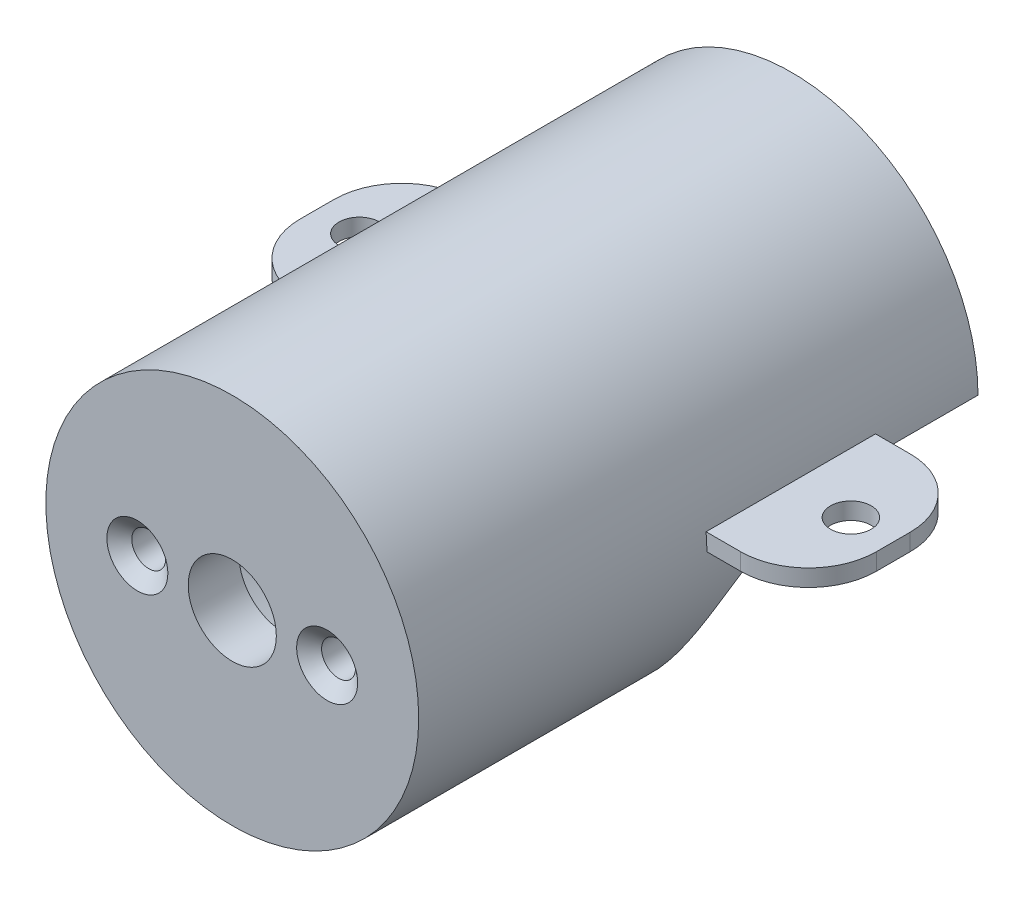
ISO-10303-21;
HEADER;
FILE_DESCRIPTION(('STEP AP214'),'2;1');
FILE_NAME('part.step','',(''),(''),'','','');
FILE_SCHEMA(('AUTOMOTIVE_DESIGN { 1 0 10303 214 1 1 1 1 }'));
ENDSEC;
DATA;
#1=APPLICATION_CONTEXT('core data for automotive mechanical design processes');
#2=APPLICATION_PROTOCOL_DEFINITION('international standard','automotive_design',2000,#1);
#3=PRODUCT_CONTEXT('',#1,'mechanical');
#4=PRODUCT('Part','Part','',(#3));
#5=PRODUCT_RELATED_PRODUCT_CATEGORY('part','',(#4));
#6=PRODUCT_DEFINITION_FORMATION('','',#4);
#7=PRODUCT_DEFINITION_CONTEXT('part definition',#1,'design');
#8=PRODUCT_DEFINITION('design','',#6,#7);
#9=PRODUCT_DEFINITION_SHAPE('','',#8);
#10=(LENGTH_UNIT() NAMED_UNIT(*) SI_UNIT(.MILLI.,.METRE.));
#11=(NAMED_UNIT(*) PLANE_ANGLE_UNIT() SI_UNIT($,.RADIAN.));
#12=(NAMED_UNIT(*) SI_UNIT($,.STERADIAN.) SOLID_ANGLE_UNIT());
#13=UNCERTAINTY_MEASURE_WITH_UNIT(LENGTH_MEASURE(1.E-05),#10,'distance_accuracy_value','');
#14=(GEOMETRIC_REPRESENTATION_CONTEXT(3) GLOBAL_UNCERTAINTY_ASSIGNED_CONTEXT((#13)) GLOBAL_UNIT_ASSIGNED_CONTEXT((#10,
#11,#12)) REPRESENTATION_CONTEXT('',''));
#15=CARTESIAN_POINT('',(0.,0.,0.));
#16=DIRECTION('',(0.,0.,1.));
#17=DIRECTION('',(1.,0.,0.));
#18=AXIS2_PLACEMENT_3D('',#15,#16,#17);
#19=CARTESIAN_POINT('',(0.,0.,-38.1));
#20=DIRECTION('',(0.,0.,1.));
#21=DIRECTION('',(1.,0.,0.));
#22=AXIS2_PLACEMENT_3D('',#19,#20,#21);
#23=CYLINDRICAL_SURFACE('',#22,13.97);
#24=CARTESIAN_POINT('',(-9.58828973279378,-10.1600000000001,-17.78));
#25=CARTESIAN_POINT('',(-9.79175012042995,-9.96804761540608,-17.7799917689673));
#26=CARTESIAN_POINT('',(-9.9894555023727,-9.76985837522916,-17.7854410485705));
#27=CARTESIAN_POINT('',(-10.3724397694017,-9.36223038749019,-17.809311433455));
#28=CARTESIAN_POINT('',(-10.5577070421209,-9.15278144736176,-17.8277444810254));
#29=CARTESIAN_POINT('',(-10.9152856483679,-8.72329717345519,-17.8797581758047));
#30=CARTESIAN_POINT('',(-11.0875379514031,-8.50322025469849,-17.9134035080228));
#31=CARTESIAN_POINT('',(-11.4170761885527,-8.05534074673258,-17.9977713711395));
#32=CARTESIAN_POINT('',(-11.574366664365,-7.8275405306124,-18.0484886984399));
#33=CARTESIAN_POINT('',(-11.8740811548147,-7.36502008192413,-18.169065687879));
#34=CARTESIAN_POINT('',(-12.0164016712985,-7.13026444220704,-18.2390478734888));
#35=CARTESIAN_POINT('',(-12.2843134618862,-6.65809456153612,-18.3993288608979));
#36=CARTESIAN_POINT('',(-12.4099032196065,-6.42068008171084,-18.4896295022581));
#37=CARTESIAN_POINT('',(-12.6436585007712,-5.94712674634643,-18.6910383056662));
#38=CARTESIAN_POINT('',(-12.7518766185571,-5.71098621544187,-18.8020813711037));
#39=CARTESIAN_POINT('',(-12.9514898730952,-5.24257717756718,-19.0453851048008));
#40=CARTESIAN_POINT('',(-13.0428870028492,-5.0103082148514,-19.1776432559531));
#41=CARTESIAN_POINT('',(-13.2006259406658,-4.57730310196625,-19.447819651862));
#42=CARTESIAN_POINT('',(-13.2685995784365,-4.37584343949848,-19.5836344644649));
#43=CARTESIAN_POINT('',(-13.3924081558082,-3.98084649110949,-19.8713354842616));
#44=CARTESIAN_POINT('',(-13.4482439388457,-3.78730865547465,-20.0232205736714));
#45=CARTESIAN_POINT('',(-13.548843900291,-3.40997196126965,-20.342378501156));
#46=CARTESIAN_POINT('',(-13.5935967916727,-3.22618317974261,-20.509666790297));
#47=CARTESIAN_POINT('',(-13.6731639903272,-2.87032044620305,-20.8584570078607));
#48=CARTESIAN_POINT('',(-13.7079779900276,-2.6982468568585,-21.0399593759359));
#49=CARTESIAN_POINT('',(-13.7689864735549,-2.36732555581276,-21.4160010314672));
#50=CARTESIAN_POINT('',(-13.7951805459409,-2.2084784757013,-21.6105409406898));
#51=CARTESIAN_POINT('',(-13.8403139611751,-1.90528419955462,-22.0113893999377));
#52=CARTESIAN_POINT('',(-13.8592533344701,-1.76093694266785,-22.2176979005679));
#53=CARTESIAN_POINT('',(-13.8912356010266,-1.48774953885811,-22.6408387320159));
#54=CARTESIAN_POINT('',(-13.9042770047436,-1.35891331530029,-22.8576737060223));
#55=CARTESIAN_POINT('',(-13.9257479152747,-1.11763932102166,-23.3005061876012));
#56=CARTESIAN_POINT('',(-13.934177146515,-1.00520253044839,-23.5265042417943));
#57=CARTESIAN_POINT('',(-13.9481609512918,-0.788925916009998,-24.0051481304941));
#58=CARTESIAN_POINT('',(-13.9534239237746,-0.686541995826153,-24.2584614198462));
#59=CARTESIAN_POINT('',(-13.9612643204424,-0.502482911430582,-24.7725830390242));
#60=CARTESIAN_POINT('',(-13.9638412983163,-0.420811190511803,-25.0333926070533));
#61=CARTESIAN_POINT('',(-13.9673979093,-0.278814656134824,-25.5604634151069));
#62=CARTESIAN_POINT('',(-13.9683792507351,-0.218467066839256,-25.8267185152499));
#63=CARTESIAN_POINT('',(-13.9695776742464,-0.119412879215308,-26.3631218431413));
#64=CARTESIAN_POINT('',(-13.9697951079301,-0.0806963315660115,-26.6332682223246));
#65=CARTESIAN_POINT('',(-13.9699662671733,-0.0352706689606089,-27.0766270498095));
#66=CARTESIAN_POINT('',(-13.9699873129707,-0.0220356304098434,-27.2491972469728));
#67=CARTESIAN_POINT('',(-13.9700001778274,-0.00440653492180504,-27.594506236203));
#68=CARTESIAN_POINT('',(-13.9699920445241,1.91385205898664E-06,-27.7672442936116));
#69=CARTESIAN_POINT('',(-13.97,0.,-27.9400000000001));
#70=B_SPLINE_CURVE_WITH_KNOTS('',3,(#24,#25,#26,#27,#28,#29,#30,#31,#32,#33,#34,#35,#36,#37,#38,
#39,#40,#41,#42,#43,#44,#45,#46,#47,#48,#49,#50,#51,#52,#53,#54,#55,#56,#57,#58,#59,#60,#61,#62,
#63,#64,#65,#66,#67,#68,#69),.UNSPECIFIED.,.F.,.F.,(4,2,2,2,2,2,2,2,2,2,2,2,2,2,2,2,2,2,2,2,2,2,
4),(0.,0.839114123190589,1.67900106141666,2.52249341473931,3.36572890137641,4.21445641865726,
5.06326080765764,5.90944480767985,6.75552848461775,7.51149106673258,8.26740110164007,
9.02407783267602,9.78077797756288,10.5375142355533,11.2942473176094,12.0511714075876,
12.8081407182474,13.6270393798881,14.4460740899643,15.2642313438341,16.082011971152,
16.6010347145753,17.119210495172),.UNSPECIFIED.);
#71=CARTESIAN_POINT('',(-9.58828973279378,-10.1600000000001,-17.78));
#72=VERTEX_POINT('',#71);
#73=CARTESIAN_POINT('',(-13.97,0.,-27.9400000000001));
#74=VERTEX_POINT('',#73);
#75=EDGE_CURVE('E166',#72,#74,#70,.T.);
#76=ORIENTED_EDGE('',*,*,#75,.F.);
#77=CARTESIAN_POINT('',(0.,0.,-17.78));
#78=DIRECTION('',(0.,0.,1.));
#79=DIRECTION('',(1.,0.,0.));
#80=AXIS2_PLACEMENT_3D('',#77,#78,#79);
#81=CIRCLE('',#80,13.97);
#82=CARTESIAN_POINT('',(9.58828973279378,-10.1600000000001,-17.78));
#83=VERTEX_POINT('',#82);
#84=EDGE_CURVE('E157',#83,#72,#81,.F.);
#85=ORIENTED_EDGE('',*,*,#84,.F.);
#86=CARTESIAN_POINT('',(13.97,0.,-27.9400000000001));
#87=CARTESIAN_POINT('',(13.9699969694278,-1.30492266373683E-07,-27.7978827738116));
#88=CARTESIAN_POINT('',(13.970000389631,-0.00298234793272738,-27.6557826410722));
#89=CARTESIAN_POINT('',(13.9699938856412,-0.0149033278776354,-27.3718360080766));
#90=CARTESIAN_POINT('',(13.9699839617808,-0.023841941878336,-27.2299895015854));
#91=CARTESIAN_POINT('',(13.9698948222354,-0.0595756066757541,-26.8052149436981));
#92=CARTESIAN_POINT('',(13.969756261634,-0.0952884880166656,-26.5229854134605));
#93=CARTESIAN_POINT('',(13.9687844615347,-0.190267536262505,-25.9623931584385));
#94=CARTESIAN_POINT('',(13.9679508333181,-0.249546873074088,-25.6840326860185));
#95=CARTESIAN_POINT('',(13.9647001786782,-0.391239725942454,-25.1332644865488));
#96=CARTESIAN_POINT('',(13.9622831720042,-0.473652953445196,-24.8608566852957));
#97=CARTESIAN_POINT('',(13.9546639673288,-0.661099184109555,-24.3237221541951));
#98=CARTESIAN_POINT('',(13.9494594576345,-0.766150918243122,-24.0590019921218));
#99=CARTESIAN_POINT('',(13.9347869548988,-0.998049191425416,-23.5394105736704));
#100=CARTESIAN_POINT('',(13.9253191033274,-1.12489500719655,-23.2845389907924));
#101=CARTESIAN_POINT('',(13.9004227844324,-1.39932534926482,-22.7866574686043));
#102=CARTESIAN_POINT('',(13.884996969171,-1.54690062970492,-22.5436423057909));
#103=CARTESIAN_POINT('',(13.8463192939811,-1.86157385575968,-22.0712476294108));
#104=CARTESIAN_POINT('',(13.8230676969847,-2.02867114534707,-21.841867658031));
#105=CARTESIAN_POINT('',(13.7673887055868,-2.37704453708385,-21.4033394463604));
#106=CARTESIAN_POINT('',(13.7351684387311,-2.55794044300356,-21.1938631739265));
#107=CARTESIAN_POINT('',(13.659539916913,-2.93510553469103,-20.7913955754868));
#108=CARTESIAN_POINT('',(13.6161317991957,-3.13137453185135,-20.5984040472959));
#109=CARTESIAN_POINT('',(13.5164512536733,-3.5369488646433,-20.2305452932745));
#110=CARTESIAN_POINT('',(13.4601876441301,-3.7462451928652,-20.0556657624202));
#111=CARTESIAN_POINT('',(13.3332992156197,-4.17541258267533,-19.7251569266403));
#112=CARTESIAN_POINT('',(13.2626756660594,-4.39528270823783,-19.5695259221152));
#113=CARTESIAN_POINT('',(13.1122234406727,-4.82473126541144,-19.2900990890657));
#114=CARTESIAN_POINT('',(13.0335880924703,-5.03371987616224,-19.1647508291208));
#115=CARTESIAN_POINT('',(12.8626348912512,-5.45576224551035,-18.9314554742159));
#116=CARTESIAN_POINT('',(12.770317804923,-5.6688157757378,-18.8235074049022));
#117=CARTESIAN_POINT('',(12.5717477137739,-6.09652804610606,-18.6249908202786));
#118=CARTESIAN_POINT('',(12.4654937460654,-6.31118689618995,-18.5344235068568));
#119=CARTESIAN_POINT('',(12.2391331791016,-6.73967546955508,-18.3702757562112));
#120=CARTESIAN_POINT('',(12.1190267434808,-6.95350520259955,-18.2966951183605));
#121=CARTESIAN_POINT('',(11.8687692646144,-7.37232067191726,-18.1675300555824));
#122=CARTESIAN_POINT('',(11.7389789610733,-7.57738898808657,-18.1115116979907));
#123=CARTESIAN_POINT('',(11.4671588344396,-7.98277709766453,-18.0138336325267));
#124=CARTESIAN_POINT('',(11.3251282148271,-8.18309658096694,-17.9721748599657));
#125=CARTESIAN_POINT('',(11.0295585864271,-8.57732041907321,-17.9020317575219));
#126=CARTESIAN_POINT('',(10.8760231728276,-8.77122675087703,-17.8735433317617));
#127=CARTESIAN_POINT('',(10.5581843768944,-9.15133854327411,-17.8283817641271));
#128=CARTESIAN_POINT('',(10.3938841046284,-9.33754620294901,-17.8117052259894));
#129=CARTESIAN_POINT('',(10.1219920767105,-9.62958277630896,-17.7932538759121));
#130=CARTESIAN_POINT('',(10.0175585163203,-9.73817840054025,-17.7881966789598));
#131=CARTESIAN_POINT('',(9.80539935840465,-9.95176677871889,-17.7815736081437));
#132=CARTESIAN_POINT('',(9.69768107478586,-10.0567665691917,-17.780000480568));
#133=CARTESIAN_POINT('',(9.58828973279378,-10.1600000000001,-17.78));
#134=B_SPLINE_CURVE_WITH_KNOTS('',3,(#86,#87,#88,#89,#90,#91,#92,#93,#94,#95,#96,#97,#98,#99,
#100,#101,#102,#103,#104,#105,#106,#107,#108,#109,#110,#111,#112,#113,#114,#115,#116,#117,#118,
#119,#120,#121,#122,#123,#124,#125,#126,#127,#128,#129,#130,#131,#132,#133),.UNSPECIFIED.,.F.,
.F.,(4,2,2,2,2,2,2,2,2,2,2,2,2,2,2,2,2,2,2,2,2,2,2,4),(0.,0.426286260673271,0.852561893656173,
1.70491447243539,2.55774405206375,3.41056299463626,4.26409028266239,5.1175892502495,
5.97070873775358,6.82379956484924,7.65862442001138,8.49343903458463,9.32768271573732,
10.1618526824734,10.9290887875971,11.6962819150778,12.4635280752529,13.2307651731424,
13.9771951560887,14.7236737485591,15.4699200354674,16.2159516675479,16.6680875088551,
17.1192811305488),.UNSPECIFIED.);
#135=CARTESIAN_POINT('',(13.97,0.,-27.9400000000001));
#136=VERTEX_POINT('',#135);
#137=EDGE_CURVE('E180',#136,#83,#134,.T.);
#138=ORIENTED_EDGE('',*,*,#137,.F.);
#139=DIRECTION('',(0.,0.,1.));
#140=VECTOR('',#139,1.);
#141=CARTESIAN_POINT('',(13.97,0.,-38.1));
#142=LINE('',#141,#140);
#143=CARTESIAN_POINT('',(13.97,0.,-17.78));
#144=VERTEX_POINT('',#143);
#145=EDGE_CURVE('E360',#144,#136,#142,.F.);
#146=ORIENTED_EDGE('',*,*,#145,.F.);
#147=CARTESIAN_POINT('',(0.,0.,-17.78));
#148=DIRECTION('',(0.,0.,-1.));
#149=DIRECTION('',(-1.,0.,0.));
#150=AXIS2_PLACEMENT_3D('',#147,#148,#149);
#151=CIRCLE('',#150,13.97);
#152=CARTESIAN_POINT('',(13.9121529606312,1.27,-17.78));
#153=VERTEX_POINT('',#152);
#154=EDGE_CURVE('E52',#144,#153,#151,.F.);
#155=ORIENTED_EDGE('',*,*,#154,.T.);
#156=DIRECTION('',(0.,0.,1.));
#157=VECTOR('',#156,1.);
#158=CARTESIAN_POINT('',(13.9121529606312,1.27,-38.1));
#159=LINE('',#158,#157);
#160=CARTESIAN_POINT('',(13.9121529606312,1.27,-30.48));
#161=VERTEX_POINT('',#160);
#162=EDGE_CURVE('E41',#153,#161,#159,.F.);
#163=ORIENTED_EDGE('',*,*,#162,.T.);
#164=CARTESIAN_POINT('',(0.,0.,-30.48));
#165=DIRECTION('',(0.,0.,1.));
#166=DIRECTION('',(1.,0.,0.));
#167=AXIS2_PLACEMENT_3D('',#164,#165,#166);
#168=CIRCLE('',#167,13.97);
#169=CARTESIAN_POINT('',(13.97,0.,-30.48));
#170=VERTEX_POINT('',#169);
#171=EDGE_CURVE('E365',#161,#170,#168,.F.);
#172=ORIENTED_EDGE('',*,*,#171,.T.);
#173=DIRECTION('',(0.,0.,1.));
#174=VECTOR('',#173,1.);
#175=CARTESIAN_POINT('',(13.97,0.,-40.5624306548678));
#176=LINE('',#175,#174);
#177=CARTESIAN_POINT('',(13.97,0.,-38.1));
#178=VERTEX_POINT('',#177);
#179=EDGE_CURVE('E332',#178,#170,#176,.T.);
#180=ORIENTED_EDGE('',*,*,#179,.F.);
#181=CARTESIAN_POINT('',(0.,0.,-38.1));
#182=DIRECTION('',(0.,0.,1.));
#183=DIRECTION('',(1.,0.,0.));
#184=AXIS2_PLACEMENT_3D('',#181,#182,#183);
#185=CIRCLE('',#184,13.97);
#186=CARTESIAN_POINT('',(-13.97,0.,-38.1));
#187=VERTEX_POINT('',#186);
#188=EDGE_CURVE('E272',#178,#187,#185,.T.);
#189=ORIENTED_EDGE('',*,*,#188,.T.);
#190=DIRECTION('',(0.,0.,1.));
#191=VECTOR('',#190,1.);
#192=CARTESIAN_POINT('',(-13.97,0.,-40.5624306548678));
#193=LINE('',#192,#191);
#194=CARTESIAN_POINT('',(-13.97,0.,-30.48));
#195=VERTEX_POINT('',#194);
#196=EDGE_CURVE('E329',#187,#195,#193,.T.);
#197=ORIENTED_EDGE('',*,*,#196,.T.);
#198=CARTESIAN_POINT('',(0.,0.,-30.48));
#199=DIRECTION('',(0.,0.,1.));
#200=DIRECTION('',(1.,0.,0.));
#201=AXIS2_PLACEMENT_3D('',#198,#199,#200);
#202=CIRCLE('',#201,13.97);
#203=CARTESIAN_POINT('',(-13.9121529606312,1.27,-30.48));
#204=VERTEX_POINT('',#203);
#205=EDGE_CURVE('E322',#195,#204,#202,.F.);
#206=ORIENTED_EDGE('',*,*,#205,.T.);
#207=DIRECTION('',(0.,0.,1.));
#208=VECTOR('',#207,1.);
#209=CARTESIAN_POINT('',(-13.9121529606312,1.27,-38.1));
#210=LINE('',#209,#208);
#211=CARTESIAN_POINT('',(-13.9121529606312,1.27,-17.78));
#212=VERTEX_POINT('',#211);
#213=EDGE_CURVE('E307',#212,#204,#210,.F.);
#214=ORIENTED_EDGE('',*,*,#213,.F.);
#215=CARTESIAN_POINT('',(0.,0.,-17.78));
#216=DIRECTION('',(0.,0.,-1.));
#217=DIRECTION('',(-1.,0.,0.));
#218=AXIS2_PLACEMENT_3D('',#215,#216,#217);
#219=CIRCLE('',#218,13.97);
#220=CARTESIAN_POINT('',(-13.97,0.,-17.78));
#221=VERTEX_POINT('',#220);
#222=EDGE_CURVE('E305',#212,#221,#219,.F.);
#223=ORIENTED_EDGE('',*,*,#222,.T.);
#224=DIRECTION('',(0.,0.,1.));
#225=VECTOR('',#224,1.);
#226=CARTESIAN_POINT('',(-13.97,0.,-38.1));
#227=LINE('',#226,#225);
#228=EDGE_CURVE('E179',#221,#74,#227,.F.);
#229=ORIENTED_EDGE('',*,*,#228,.T.);
#230=EDGE_LOOP('',(#76,#85,#138,#146,#155,#163,#172,#180,#189,#197,#206,#214,#223,#229));
#231=FACE_BOUND('',#230,.T.);
#232=CARTESIAN_POINT('',(0.,0.,3.81));
#233=DIRECTION('',(0.,0.,1.));
#234=DIRECTION('',(1.,0.,0.));
#235=AXIS2_PLACEMENT_3D('',#232,#233,#234);
#236=CIRCLE('',#235,13.97);
#237=CARTESIAN_POINT('',(13.97,0.,3.81));
#238=VERTEX_POINT('',#237);
#239=EDGE_CURVE('E277',#238,#238,#236,.T.);
#240=ORIENTED_EDGE('',*,*,#239,.F.);
#241=EDGE_LOOP('',(#240));
#242=FACE_BOUND('',#241,.T.);
#243=ADVANCED_FACE('F33',(#231,#242),#23,.T.);
#244=CARTESIAN_POINT('',(0.,0.,3.81));
#245=DIRECTION('',(0.,0.,1.));
#246=DIRECTION('',(1.,0.,0.));
#247=AXIS2_PLACEMENT_3D('',#244,#245,#246);
#248=PLANE('',#247);
#249=CARTESIAN_POINT('',(-7.112,0.,3.81));
#250=DIRECTION('',(0.,0.,1.));
#251=DIRECTION('',(1.,0.,0.));
#252=AXIS2_PLACEMENT_3D('',#249,#250,#251);
#253=CIRCLE('',#252,2.286);
#254=CARTESIAN_POINT('',(-4.826,0.,3.81));
#255=VERTEX_POINT('',#254);
#256=EDGE_CURVE('E271',#255,#255,#253,.T.);
#257=ORIENTED_EDGE('',*,*,#256,.F.);
#258=EDGE_LOOP('',(#257));
#259=FACE_BOUND('',#258,.T.);
#260=CARTESIAN_POINT('',(7.112,0.,3.81));
#261=DIRECTION('',(0.,0.,1.));
#262=DIRECTION('',(1.,0.,0.));
#263=AXIS2_PLACEMENT_3D('',#260,#261,#262);
#264=CIRCLE('',#263,2.286);
#265=CARTESIAN_POINT('',(9.398,0.,3.81));
#266=VERTEX_POINT('',#265);
#267=EDGE_CURVE('E274',#266,#266,#264,.T.);
#268=ORIENTED_EDGE('',*,*,#267,.F.);
#269=EDGE_LOOP('',(#268));
#270=FACE_BOUND('',#269,.T.);
#271=CARTESIAN_POINT('',(0.,0.,3.81));
#272=DIRECTION('',(0.,0.,1.));
#273=DIRECTION('',(1.,0.,0.));
#274=AXIS2_PLACEMENT_3D('',#271,#272,#273);
#275=CIRCLE('',#274,3.302);
#276=CARTESIAN_POINT('',(3.302,0.,3.81));
#277=VERTEX_POINT('',#276);
#278=EDGE_CURVE('E290',#277,#277,#275,.T.);
#279=ORIENTED_EDGE('',*,*,#278,.F.);
#280=EDGE_LOOP('',(#279));
#281=FACE_BOUND('',#280,.T.);
#282=ORIENTED_EDGE('',*,*,#239,.T.);
#283=EDGE_LOOP('',(#282));
#284=FACE_BOUND('',#283,.T.);
#285=ADVANCED_FACE('F235',(#259,#270,#281,#284),#248,.T.);
#286=CARTESIAN_POINT('',(0.,0.,0.));
#287=DIRECTION('',(0.,0.,1.));
#288=DIRECTION('',(1.,0.,0.));
#289=AXIS2_PLACEMENT_3D('',#286,#287,#288);
#290=PLANE('',#289);
#291=CARTESIAN_POINT('',(7.112,0.,0.));
#292=DIRECTION('',(0.,0.,1.));
#293=DIRECTION('',(-1.,0.,0.));
#294=AXIS2_PLACEMENT_3D('',#291,#292,#293);
#295=CIRCLE('',#294,1.27);
#296=CARTESIAN_POINT('',(8.382,0.,0.));
#297=VERTEX_POINT('',#296);
#298=EDGE_CURVE('E286',#297,#297,#295,.T.);
#299=ORIENTED_EDGE('',*,*,#298,.T.);
#300=EDGE_LOOP('',(#299));
#301=FACE_BOUND('',#300,.T.);
#302=CARTESIAN_POINT('',(-7.112,0.,0.));
#303=DIRECTION('',(0.,0.,1.));
#304=DIRECTION('',(1.,0.,0.));
#305=AXIS2_PLACEMENT_3D('',#302,#303,#304);
#306=CIRCLE('',#305,1.27);
#307=CARTESIAN_POINT('',(-5.842,0.,0.));
#308=VERTEX_POINT('',#307);
#309=EDGE_CURVE('E287',#308,#308,#306,.T.);
#310=ORIENTED_EDGE('',*,*,#309,.T.);
#311=EDGE_LOOP('',(#310));
#312=FACE_BOUND('',#311,.T.);
#313=CARTESIAN_POINT('',(0.,0.,0.));
#314=DIRECTION('',(0.,0.,1.));
#315=DIRECTION('',(1.,0.,0.));
#316=AXIS2_PLACEMENT_3D('',#313,#314,#315);
#317=CIRCLE('',#316,3.302);
#318=CARTESIAN_POINT('',(3.302,0.,0.));
#319=VERTEX_POINT('',#318);
#320=EDGE_CURVE('E293',#319,#319,#317,.T.);
#321=ORIENTED_EDGE('',*,*,#320,.T.);
#322=EDGE_LOOP('',(#321));
#323=FACE_BOUND('',#322,.T.);
#324=CARTESIAN_POINT('',(0.,0.,0.));
#325=DIRECTION('',(0.,0.,1.));
#326=DIRECTION('',(1.,0.,0.));
#327=AXIS2_PLACEMENT_3D('',#324,#325,#326);
#328=CIRCLE('',#327,12.7);
#329=CARTESIAN_POINT('',(12.7,0.,0.));
#330=VERTEX_POINT('',#329);
#331=EDGE_CURVE('E296',#330,#330,#328,.T.);
#332=ORIENTED_EDGE('',*,*,#331,.F.);
#333=EDGE_LOOP('',(#332));
#334=FACE_BOUND('',#333,.T.);
#335=ADVANCED_FACE('F35',(#301,#312,#323,#334),#290,.F.);
#336=CARTESIAN_POINT('',(0.,0.,0.));
#337=DIRECTION('',(0.,0.,1.));
#338=DIRECTION('',(1.,0.,0.));
#339=AXIS2_PLACEMENT_3D('',#336,#337,#338);
#340=CYLINDRICAL_SURFACE('',#339,3.302);
#341=CARTESIAN_POINT('',(3.302,0.,0.));
#342=CARTESIAN_POINT('',(3.302,0.,0.0396874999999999));
#343=CARTESIAN_POINT('',(3.302,0.,0.079375));
#344=CARTESIAN_POINT('',(3.302,0.,0.15875));
#345=CARTESIAN_POINT('',(3.302,0.,0.1984375));
#346=CARTESIAN_POINT('',(3.302,0.,0.2778125));
#347=CARTESIAN_POINT('',(3.302,0.,0.3175));
#348=CARTESIAN_POINT('',(3.302,0.,0.396875));
#349=CARTESIAN_POINT('',(3.302,0.,0.4365625));
#350=CARTESIAN_POINT('',(3.302,0.,0.5159375));
#351=CARTESIAN_POINT('',(3.302,0.,0.555625));
#352=CARTESIAN_POINT('',(3.302,0.,0.635));
#353=CARTESIAN_POINT('',(3.302,0.,0.6746875));
#354=CARTESIAN_POINT('',(3.302,0.,0.7540625));
#355=CARTESIAN_POINT('',(3.302,0.,0.79375));
#356=CARTESIAN_POINT('',(3.302,0.,0.873125));
#357=CARTESIAN_POINT('',(3.302,0.,0.9128125));
#358=CARTESIAN_POINT('',(3.302,0.,0.9921875));
#359=CARTESIAN_POINT('',(3.302,0.,1.031875));
#360=CARTESIAN_POINT('',(3.302,0.,1.11125));
#361=CARTESIAN_POINT('',(3.302,0.,1.1509375));
#362=CARTESIAN_POINT('',(3.302,0.,1.2303125));
#363=CARTESIAN_POINT('',(3.302,0.,1.27));
#364=CARTESIAN_POINT('',(3.302,0.,1.349375));
#365=CARTESIAN_POINT('',(3.302,0.,1.3890625));
#366=CARTESIAN_POINT('',(3.302,0.,1.4684375));
#367=CARTESIAN_POINT('',(3.302,0.,1.508125));
#368=CARTESIAN_POINT('',(3.302,0.,1.5875));
#369=CARTESIAN_POINT('',(3.302,0.,1.6271875));
#370=CARTESIAN_POINT('',(3.302,0.,1.7065625));
#371=CARTESIAN_POINT('',(3.302,0.,1.74625));
#372=CARTESIAN_POINT('',(3.302,0.,1.825625));
#373=CARTESIAN_POINT('',(3.302,0.,1.8653125));
#374=CARTESIAN_POINT('',(3.302,0.,1.9446875));
#375=CARTESIAN_POINT('',(3.302,0.,1.984375));
#376=CARTESIAN_POINT('',(3.302,0.,2.06375));
#377=CARTESIAN_POINT('',(3.302,0.,2.1034375));
#378=CARTESIAN_POINT('',(3.302,0.,2.1828125));
#379=CARTESIAN_POINT('',(3.302,0.,2.2225));
#380=CARTESIAN_POINT('',(3.302,0.,2.301875));
#381=CARTESIAN_POINT('',(3.302,0.,2.3415625));
#382=CARTESIAN_POINT('',(3.302,0.,2.4209375));
#383=CARTESIAN_POINT('',(3.302,0.,2.460625));
#384=CARTESIAN_POINT('',(3.302,0.,2.54));
#385=CARTESIAN_POINT('',(3.302,0.,2.5796875));
#386=CARTESIAN_POINT('',(3.302,0.,2.6590625));
#387=CARTESIAN_POINT('',(3.302,0.,2.69875));
#388=CARTESIAN_POINT('',(3.302,0.,2.778125));
#389=CARTESIAN_POINT('',(3.302,0.,2.8178125));
#390=CARTESIAN_POINT('',(3.302,0.,2.8971875));
#391=CARTESIAN_POINT('',(3.302,0.,2.936875));
#392=CARTESIAN_POINT('',(3.302,0.,3.01625));
#393=CARTESIAN_POINT('',(3.302,0.,3.0559375));
#394=CARTESIAN_POINT('',(3.302,0.,3.1353125));
#395=CARTESIAN_POINT('',(3.302,0.,3.175));
#396=CARTESIAN_POINT('',(3.302,0.,3.254375));
#397=CARTESIAN_POINT('',(3.302,0.,3.2940625));
#398=CARTESIAN_POINT('',(3.302,0.,3.3734375));
#399=CARTESIAN_POINT('',(3.302,0.,3.413125));
#400=CARTESIAN_POINT('',(3.302,0.,3.4925));
#401=CARTESIAN_POINT('',(3.302,0.,3.5321875));
#402=CARTESIAN_POINT('',(3.302,0.,3.6115625));
#403=CARTESIAN_POINT('',(3.302,0.,3.65125));
#404=CARTESIAN_POINT('',(3.302,0.,3.730625));
#405=CARTESIAN_POINT('',(3.302,0.,3.7703125));
#406=CARTESIAN_POINT('',(3.302,0.,3.81));
#407=B_SPLINE_CURVE_WITH_KNOTS('',3,(#341,#342,#343,#344,#345,#346,#347,#348,#349,#350,#351,
#352,#353,#354,#355,#356,#357,#358,#359,#360,#361,#362,#363,#364,#365,#366,#367,#368,#369,#370,
#371,#372,#373,#374,#375,#376,#377,#378,#379,#380,#381,#382,#383,#384,#385,#386,#387,#388,#389,
#390,#391,#392,#393,#394,#395,#396,#397,#398,#399,#400,#401,#402,#403,#404,#405,#406),
.UNSPECIFIED.,.F.,.F.,(4,2,2,2,2,2,2,2,2,2,2,2,2,2,2,2,2,2,2,2,2,2,2,2,2,2,2,2,2,2,2,2,4),(0.,
0.1190625,0.238125,0.3571875,0.47625,0.5953125,0.714375,0.8334375,0.9525,1.0715625,1.190625,
1.3096875,1.42875,1.5478125,1.666875,1.7859375,1.905,2.0240625,2.143125,2.2621875,2.38125,
2.5003125,2.619375,2.7384375,2.8575,2.9765625,3.095625,3.2146875,3.33375,3.4528125,3.571875,
3.6909375,3.81),.UNSPECIFIED.);
#408=EDGE_CURVE('BSEAM243',#319,#277,#407,.T.);
#409=ORIENTED_EDGE('',*,*,#320,.F.);
#410=ORIENTED_EDGE('',*,*,#278,.T.);
#411=ORIENTED_EDGE('',*,*,#408,.T.);
#412=ORIENTED_EDGE('',*,*,#408,.F.);
#413=EDGE_LOOP('',(#409,#411,#410,#412));
#414=FACE_BOUND('',#413,.T.);
#415=ADVANCED_FACE('F243',(#414),#340,.F.);
#416=CARTESIAN_POINT('',(-7.112,0.,0.));
#417=DIRECTION('',(0.,0.,1.));
#418=DIRECTION('',(1.,0.,0.));
#419=AXIS2_PLACEMENT_3D('',#416,#417,#418);
#420=CYLINDRICAL_SURFACE('',#419,1.27);
#421=CARTESIAN_POINT('',(-7.112,0.,2.95747477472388));
#422=DIRECTION('',(0.,0.,1.));
#423=DIRECTION('',(1.,0.,0.));
#424=AXIS2_PLACEMENT_3D('',#421,#422,#423);
#425=CIRCLE('',#424,1.27);
#426=CARTESIAN_POINT('',(-5.842,0.,2.95747477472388));
#427=VERTEX_POINT('',#426);
#428=EDGE_CURVE('E269',#427,#427,#425,.T.);
#429=CARTESIAN_POINT('',(-5.842,0.,2.95747477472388));
#430=CARTESIAN_POINT('',(-5.842,0.,2.92666774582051));
#431=CARTESIAN_POINT('',(-5.842,0.,2.89586071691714));
#432=CARTESIAN_POINT('',(-5.842,0.,2.83424665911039));
#433=CARTESIAN_POINT('',(-5.842,0.,2.80343963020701));
#434=CARTESIAN_POINT('',(-5.842,0.,2.74182557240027));
#435=CARTESIAN_POINT('',(-5.842,0.,2.71101854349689));
#436=CARTESIAN_POINT('',(-5.842,0.,2.64940448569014));
#437=CARTESIAN_POINT('',(-5.842,0.,2.61859745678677));
#438=CARTESIAN_POINT('',(-5.842,0.,2.55698339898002));
#439=CARTESIAN_POINT('',(-5.842,0.,2.52617637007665));
#440=CARTESIAN_POINT('',(-5.842,0.,2.4645623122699));
#441=CARTESIAN_POINT('',(-5.842,0.,2.43375528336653));
#442=CARTESIAN_POINT('',(-5.842,0.,2.37214122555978));
#443=CARTESIAN_POINT('',(-5.842,0.,2.34133419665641));
#444=CARTESIAN_POINT('',(-5.842,0.,2.27972013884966));
#445=CARTESIAN_POINT('',(-5.842,0.,2.24891310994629));
#446=CARTESIAN_POINT('',(-5.842,0.,2.18729905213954));
#447=CARTESIAN_POINT('',(-5.842,0.,2.15649202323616));
#448=CARTESIAN_POINT('',(-5.842,0.,2.09487796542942));
#449=CARTESIAN_POINT('',(-5.842,0.,2.06407093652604));
#450=CARTESIAN_POINT('',(-5.842,0.,2.0024568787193));
#451=CARTESIAN_POINT('',(-5.842,0.,1.97164984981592));
#452=CARTESIAN_POINT('',(-5.842,0.,1.91003579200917));
#453=CARTESIAN_POINT('',(-5.842,0.,1.8792287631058));
#454=CARTESIAN_POINT('',(-5.842,0.,1.81761470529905));
#455=CARTESIAN_POINT('',(-5.842,0.,1.78680767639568));
#456=CARTESIAN_POINT('',(-5.842,0.,1.72519361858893));
#457=CARTESIAN_POINT('',(-5.842,0.,1.69438658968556));
#458=CARTESIAN_POINT('',(-5.842,0.,1.63277253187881));
#459=CARTESIAN_POINT('',(-5.842,0.,1.60196550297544));
#460=CARTESIAN_POINT('',(-5.842,0.,1.54035144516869));
#461=CARTESIAN_POINT('',(-5.842,0.,1.50954441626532));
#462=CARTESIAN_POINT('',(-5.842,0.,1.44793035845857));
#463=CARTESIAN_POINT('',(-5.842,0.,1.41712332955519));
#464=CARTESIAN_POINT('',(-5.842,0.,1.35550927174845));
#465=CARTESIAN_POINT('',(-5.842,0.,1.32470224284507));
#466=CARTESIAN_POINT('',(-5.842,0.,1.26308818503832));
#467=CARTESIAN_POINT('',(-5.842,0.,1.23228115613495));
#468=CARTESIAN_POINT('',(-5.842,0.,1.1706670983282));
#469=CARTESIAN_POINT('',(-5.842,0.,1.13986006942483));
#470=CARTESIAN_POINT('',(-5.842,0.,1.07824601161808));
#471=CARTESIAN_POINT('',(-5.842,0.,1.04743898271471));
#472=CARTESIAN_POINT('',(-5.842,0.,0.985824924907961));
#473=CARTESIAN_POINT('',(-5.842,0.,0.955017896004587));
#474=CARTESIAN_POINT('',(-5.842,0.,0.893403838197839));
#475=CARTESIAN_POINT('',(-5.842,0.,0.862596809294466));
#476=CARTESIAN_POINT('',(-5.842,0.,0.800982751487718));
#477=CARTESIAN_POINT('',(-5.842,0.,0.770175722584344));
#478=CARTESIAN_POINT('',(-5.842,0.,0.708561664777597));
#479=CARTESIAN_POINT('',(-5.842,0.,0.677754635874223));
#480=CARTESIAN_POINT('',(-5.842,0.,0.616140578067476));
#481=CARTESIAN_POINT('',(-5.842,0.,0.585333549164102));
#482=CARTESIAN_POINT('',(-5.842,0.,0.523719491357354));
#483=CARTESIAN_POINT('',(-5.842,0.,0.492912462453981));
#484=CARTESIAN_POINT('',(-5.842,0.,0.431298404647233));
#485=CARTESIAN_POINT('',(-5.842,0.,0.400491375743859));
#486=CARTESIAN_POINT('',(-5.842,0.,0.338877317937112));
#487=CARTESIAN_POINT('',(-5.842,0.,0.308070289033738));
#488=CARTESIAN_POINT('',(-5.842,0.,0.24645623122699));
#489=CARTESIAN_POINT('',(-5.842,0.,0.215649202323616));
#490=CARTESIAN_POINT('',(-5.842,0.,0.154035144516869));
#491=CARTESIAN_POINT('',(-5.842,0.,0.123228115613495));
#492=CARTESIAN_POINT('',(-5.842,0.,0.0616140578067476));
#493=CARTESIAN_POINT('',(-5.842,0.,0.0308070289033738));
#494=CARTESIAN_POINT('',(-5.842,0.,0.));
#495=B_SPLINE_CURVE_WITH_KNOTS('',3,(#429,#430,#431,#432,#433,#434,#435,#436,#437,#438,#439,
#440,#441,#442,#443,#444,#445,#446,#447,#448,#449,#450,#451,#452,#453,#454,#455,#456,#457,#458,
#459,#460,#461,#462,#463,#464,#465,#466,#467,#468,#469,#470,#471,#472,#473,#474,#475,#476,#477,
#478,#479,#480,#481,#482,#483,#484,#485,#486,#487,#488,#489,#490,#491,#492,#493,#494),
.UNSPECIFIED.,.F.,.F.,(4,2,2,2,2,2,2,2,2,2,2,2,2,2,2,2,2,2,2,2,2,2,2,2,2,2,2,2,2,2,2,2,4),(0.,
0.0924210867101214,0.184842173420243,0.277263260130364,0.369684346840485,0.462105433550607,
0.554526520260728,0.64694760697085,0.739368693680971,0.831789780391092,0.924210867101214,
1.01663195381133,1.10905304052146,1.20147412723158,1.2938952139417,1.38631630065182,
1.47873738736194,1.57115847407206,1.66357956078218,1.75600064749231,1.84842173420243,
1.94084282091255,2.03326390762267,2.12568499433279,2.21810608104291,2.31052716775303,
2.40294825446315,2.49536934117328,2.5877904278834,2.68021151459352,2.77263260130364,
2.86505368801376,2.95747477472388),.UNSPECIFIED.);
#496=EDGE_CURVE('BSEAM250',#427,#308,#495,.T.);
#497=ORIENTED_EDGE('',*,*,#428,.T.);
#498=ORIENTED_EDGE('',*,*,#309,.F.);
#499=ORIENTED_EDGE('',*,*,#496,.T.);
#500=ORIENTED_EDGE('',*,*,#496,.F.);
#501=EDGE_LOOP('',(#497,#499,#498,#500));
#502=FACE_BOUND('',#501,.T.);
#503=ADVANCED_FACE('F250',(#502),#420,.F.);
#504=CARTESIAN_POINT('',(7.112,0.,0.));
#505=DIRECTION('',(0.,0.,1.));
#506=DIRECTION('',(1.,0.,0.));
#507=AXIS2_PLACEMENT_3D('',#504,#505,#506);
#508=CYLINDRICAL_SURFACE('',#507,1.27);
#509=CARTESIAN_POINT('',(7.112,0.,2.95747477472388));
#510=DIRECTION('',(0.,0.,1.));
#511=DIRECTION('',(1.,0.,0.));
#512=AXIS2_PLACEMENT_3D('',#509,#510,#511);
#513=CIRCLE('',#512,1.27);
#514=CARTESIAN_POINT('',(8.382,0.,2.95747477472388));
#515=VERTEX_POINT('',#514);
#516=EDGE_CURVE('E283',#515,#515,#513,.T.);
#517=CARTESIAN_POINT('',(8.382,0.,2.95747477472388));
#518=CARTESIAN_POINT('',(8.382,0.,2.92666774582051));
#519=CARTESIAN_POINT('',(8.382,0.,2.89586071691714));
#520=CARTESIAN_POINT('',(8.382,0.,2.83424665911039));
#521=CARTESIAN_POINT('',(8.382,0.,2.80343963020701));
#522=CARTESIAN_POINT('',(8.382,0.,2.74182557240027));
#523=CARTESIAN_POINT('',(8.382,0.,2.71101854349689));
#524=CARTESIAN_POINT('',(8.382,0.,2.64940448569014));
#525=CARTESIAN_POINT('',(8.382,0.,2.61859745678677));
#526=CARTESIAN_POINT('',(8.382,0.,2.55698339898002));
#527=CARTESIAN_POINT('',(8.382,0.,2.52617637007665));
#528=CARTESIAN_POINT('',(8.382,0.,2.4645623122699));
#529=CARTESIAN_POINT('',(8.382,0.,2.43375528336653));
#530=CARTESIAN_POINT('',(8.382,0.,2.37214122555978));
#531=CARTESIAN_POINT('',(8.382,0.,2.34133419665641));
#532=CARTESIAN_POINT('',(8.382,0.,2.27972013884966));
#533=CARTESIAN_POINT('',(8.382,0.,2.24891310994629));
#534=CARTESIAN_POINT('',(8.382,0.,2.18729905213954));
#535=CARTESIAN_POINT('',(8.382,0.,2.15649202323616));
#536=CARTESIAN_POINT('',(8.382,0.,2.09487796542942));
#537=CARTESIAN_POINT('',(8.382,0.,2.06407093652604));
#538=CARTESIAN_POINT('',(8.382,0.,2.0024568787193));
#539=CARTESIAN_POINT('',(8.382,0.,1.97164984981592));
#540=CARTESIAN_POINT('',(8.382,0.,1.91003579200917));
#541=CARTESIAN_POINT('',(8.382,0.,1.8792287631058));
#542=CARTESIAN_POINT('',(8.382,0.,1.81761470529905));
#543=CARTESIAN_POINT('',(8.382,0.,1.78680767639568));
#544=CARTESIAN_POINT('',(8.382,0.,1.72519361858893));
#545=CARTESIAN_POINT('',(8.382,0.,1.69438658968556));
#546=CARTESIAN_POINT('',(8.382,0.,1.63277253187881));
#547=CARTESIAN_POINT('',(8.382,0.,1.60196550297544));
#548=CARTESIAN_POINT('',(8.382,0.,1.54035144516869));
#549=CARTESIAN_POINT('',(8.382,0.,1.50954441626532));
#550=CARTESIAN_POINT('',(8.382,0.,1.44793035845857));
#551=CARTESIAN_POINT('',(8.382,0.,1.41712332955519));
#552=CARTESIAN_POINT('',(8.382,0.,1.35550927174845));
#553=CARTESIAN_POINT('',(8.382,0.,1.32470224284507));
#554=CARTESIAN_POINT('',(8.382,0.,1.26308818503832));
#555=CARTESIAN_POINT('',(8.382,0.,1.23228115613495));
#556=CARTESIAN_POINT('',(8.382,0.,1.1706670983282));
#557=CARTESIAN_POINT('',(8.382,0.,1.13986006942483));
#558=CARTESIAN_POINT('',(8.382,0.,1.07824601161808));
#559=CARTESIAN_POINT('',(8.382,0.,1.04743898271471));
#560=CARTESIAN_POINT('',(8.382,0.,0.985824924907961));
#561=CARTESIAN_POINT('',(8.382,0.,0.955017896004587));
#562=CARTESIAN_POINT('',(8.382,0.,0.893403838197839));
#563=CARTESIAN_POINT('',(8.382,0.,0.862596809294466));
#564=CARTESIAN_POINT('',(8.382,0.,0.800982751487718));
#565=CARTESIAN_POINT('',(8.382,0.,0.770175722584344));
#566=CARTESIAN_POINT('',(8.382,0.,0.708561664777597));
#567=CARTESIAN_POINT('',(8.382,0.,0.677754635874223));
#568=CARTESIAN_POINT('',(8.382,0.,0.616140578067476));
#569=CARTESIAN_POINT('',(8.382,0.,0.585333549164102));
#570=CARTESIAN_POINT('',(8.382,0.,0.523719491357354));
#571=CARTESIAN_POINT('',(8.382,0.,0.492912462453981));
#572=CARTESIAN_POINT('',(8.382,0.,0.431298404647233));
#573=CARTESIAN_POINT('',(8.382,0.,0.400491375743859));
#574=CARTESIAN_POINT('',(8.382,0.,0.338877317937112));
#575=CARTESIAN_POINT('',(8.382,0.,0.308070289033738));
#576=CARTESIAN_POINT('',(8.382,0.,0.24645623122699));
#577=CARTESIAN_POINT('',(8.382,0.,0.215649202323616));
#578=CARTESIAN_POINT('',(8.382,0.,0.154035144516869));
#579=CARTESIAN_POINT('',(8.382,0.,0.123228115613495));
#580=CARTESIAN_POINT('',(8.382,0.,0.0616140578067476));
#581=CARTESIAN_POINT('',(8.382,0.,0.0308070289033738));
#582=CARTESIAN_POINT('',(8.382,0.,0.));
#583=B_SPLINE_CURVE_WITH_KNOTS('',3,(#517,#518,#519,#520,#521,#522,#523,#524,#525,#526,#527,
#528,#529,#530,#531,#532,#533,#534,#535,#536,#537,#538,#539,#540,#541,#542,#543,#544,#545,#546,
#547,#548,#549,#550,#551,#552,#553,#554,#555,#556,#557,#558,#559,#560,#561,#562,#563,#564,#565,
#566,#567,#568,#569,#570,#571,#572,#573,#574,#575,#576,#577,#578,#579,#580,#581,#582),
.UNSPECIFIED.,.F.,.F.,(4,2,2,2,2,2,2,2,2,2,2,2,2,2,2,2,2,2,2,2,2,2,2,2,2,2,2,2,2,2,2,2,4),(0.,
0.0924210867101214,0.184842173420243,0.277263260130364,0.369684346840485,0.462105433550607,
0.554526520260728,0.64694760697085,0.739368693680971,0.831789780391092,0.924210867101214,
1.01663195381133,1.10905304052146,1.20147412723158,1.2938952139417,1.38631630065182,
1.47873738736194,1.57115847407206,1.66357956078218,1.75600064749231,1.84842173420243,
1.94084282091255,2.03326390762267,2.12568499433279,2.21810608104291,2.31052716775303,
2.40294825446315,2.49536934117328,2.5877904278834,2.68021151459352,2.77263260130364,
2.86505368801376,2.95747477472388),.UNSPECIFIED.);
#584=EDGE_CURVE('BSEAM252',#515,#297,#583,.T.);
#585=ORIENTED_EDGE('',*,*,#516,.T.);
#586=ORIENTED_EDGE('',*,*,#298,.F.);
#587=ORIENTED_EDGE('',*,*,#584,.T.);
#588=ORIENTED_EDGE('',*,*,#584,.F.);
#589=EDGE_LOOP('',(#585,#587,#586,#588));
#590=FACE_BOUND('',#589,.T.);
#591=ADVANCED_FACE('F252',(#590),#508,.F.);
#592=CARTESIAN_POINT('',(7.112,0.,3.81));
#593=DIRECTION('',(0.,0.,1.));
#594=DIRECTION('',(1.,0.,0.));
#595=AXIS2_PLACEMENT_3D('',#592,#593,#594);
#596=CONICAL_SURFACE('',#595,2.286,0.872664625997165);
#597=ORIENTED_EDGE('',*,*,#516,.F.);
#598=EDGE_LOOP('',(#597));
#599=FACE_BOUND('',#598,.T.);
#600=ORIENTED_EDGE('',*,*,#267,.T.);
#601=EDGE_LOOP('',(#600));
#602=FACE_BOUND('',#601,.T.);
#603=ADVANCED_FACE('F255',(#599,#602),#596,.F.);
#604=CARTESIAN_POINT('',(-7.112,0.,3.81));
#605=DIRECTION('',(0.,0.,1.));
#606=DIRECTION('',(1.,0.,0.));
#607=AXIS2_PLACEMENT_3D('',#604,#605,#606);
#608=CONICAL_SURFACE('',#607,2.286,0.872664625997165);
#609=ORIENTED_EDGE('',*,*,#428,.F.);
#610=EDGE_LOOP('',(#609));
#611=FACE_BOUND('',#610,.T.);
#612=ORIENTED_EDGE('',*,*,#256,.T.);
#613=EDGE_LOOP('',(#612));
#614=FACE_BOUND('',#613,.T.);
#615=ADVANCED_FACE('F221',(#611,#614),#608,.F.);
#616=CARTESIAN_POINT('',(0.,0.,-38.1));
#617=DIRECTION('',(0.,0.,1.));
#618=DIRECTION('',(1.,0.,0.));
#619=AXIS2_PLACEMENT_3D('',#616,#617,#618);
#620=CYLINDRICAL_SURFACE('',#619,12.7);
#621=CARTESIAN_POINT('',(-7.61999999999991,-10.1600000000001,-17.78));
#622=CARTESIAN_POINT('',(-7.84310127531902,-9.99272253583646,-17.7800051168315));
#623=CARTESIAN_POINT('',(-8.06071228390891,-9.81798743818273,-17.7841323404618));
#624=CARTESIAN_POINT('',(-8.48390183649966,-9.45468085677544,-17.8028763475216));
#625=CARTESIAN_POINT('',(-8.68946949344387,-9.26609719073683,-17.8175024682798));
#626=CARTESIAN_POINT('',(-9.08819979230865,-8.87541535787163,-17.8596117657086));
#627=CARTESIAN_POINT('',(-9.28128890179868,-8.67324927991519,-17.8871644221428));
#628=CARTESIAN_POINT('',(-9.65248877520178,-8.25814354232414,-17.9573734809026));
#629=CARTESIAN_POINT('',(-9.83060382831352,-8.04520699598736,-18.0000255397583));
#630=CARTESIAN_POINT('',(-10.1718491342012,-7.60924536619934,-18.1028394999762));
#631=CARTESIAN_POINT('',(-10.3348705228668,-7.38616205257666,-18.1631172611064));
#632=CARTESIAN_POINT('',(-10.6435294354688,-6.93398931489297,-18.3028616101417));
#633=CARTESIAN_POINT('',(-10.7891655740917,-6.70489941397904,-18.3823297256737));
#634=CARTESIAN_POINT('',(-11.0618305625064,-6.24477118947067,-18.5614445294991));
#635=CARTESIAN_POINT('',(-11.1889245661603,-6.013742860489,-18.6610174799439));
#636=CARTESIAN_POINT('',(-11.4248676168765,-5.55243209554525,-18.8812360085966));
#637=CARTESIAN_POINT('',(-11.5337192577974,-5.32214955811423,-19.0018785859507));
#638=CARTESIAN_POINT('',(-11.7217452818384,-4.89275197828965,-19.2488748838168));
#639=CARTESIAN_POINT('',(-11.8029040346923,-4.6931547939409,-19.3728908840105));
#640=CARTESIAN_POINT('',(-11.9518398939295,-4.29973911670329,-19.637044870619));
#641=CARTESIAN_POINT('',(-12.0196180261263,-4.10592018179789,-19.7771816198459));
#642=CARTESIAN_POINT('',(-12.1427421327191,-3.72608796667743,-20.0730816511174));
#643=CARTESIAN_POINT('',(-12.1980744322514,-3.54008345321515,-20.2288618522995));
#644=CARTESIAN_POINT('',(-12.2973529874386,-3.17810346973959,-20.5550101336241));
#645=CARTESIAN_POINT('',(-12.3412989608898,-3.00212824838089,-20.7253785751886));
#646=CARTESIAN_POINT('',(-12.4183873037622,-2.66514150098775,-21.0762721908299));
#647=CARTESIAN_POINT('',(-12.4517172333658,-2.50391086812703,-21.2565462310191));
#648=CARTESIAN_POINT('',(-12.5100185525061,-2.19414687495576,-21.628942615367));
#649=CARTESIAN_POINT('',(-12.5349901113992,-2.04561325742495,-21.8210647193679));
#650=CARTESIAN_POINT('',(-12.5779422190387,-1.76235598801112,-22.2159947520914));
#651=CARTESIAN_POINT('',(-12.5959219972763,-1.62763385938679,-22.4188038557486));
#652=CARTESIAN_POINT('',(-12.626222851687,-1.37293429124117,-22.8338879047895));
#653=CARTESIAN_POINT('',(-12.6385435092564,-1.25295794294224,-23.0461635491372));
#654=CARTESIAN_POINT('',(-12.6597211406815,-1.0181466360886,-23.4989406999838));
#655=CARTESIAN_POINT('',(-12.6681535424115,-0.904807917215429,-23.7402391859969));
#656=CARTESIAN_POINT('',(-12.6812629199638,-0.697404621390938,-24.231105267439));
#657=CARTESIAN_POINT('',(-12.6859393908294,-0.603342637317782,-24.4806739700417));
#658=CARTESIAN_POINT('',(-12.6928216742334,-0.435159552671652,-24.9863515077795));
#659=CARTESIAN_POINT('',(-12.6950285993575,-0.361029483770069,-25.2424573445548));
#660=CARTESIAN_POINT('',(-12.6980208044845,-0.233143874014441,-25.7596165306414));
#661=CARTESIAN_POINT('',(-12.6988065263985,-0.179382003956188,-26.0206683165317));
#662=CARTESIAN_POINT('',(-12.6997576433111,-0.0906980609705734,-26.5573270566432));
#663=CARTESIAN_POINT('',(-12.6998954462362,-0.0566672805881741,-26.8330831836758));
#664=CARTESIAN_POINT('',(-12.6999840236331,-0.0226614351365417,-27.2477740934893));
#665=CARTESIAN_POINT('',(-12.6999939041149,-0.0141662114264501,-27.3860600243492));
#666=CARTESIAN_POINT('',(-12.7000004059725,-0.00283502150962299,-27.6628918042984));
#667=CARTESIAN_POINT('',(-12.699997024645,-2.0934003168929E-07,-27.8014377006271));
#668=CARTESIAN_POINT('',(-12.7,0.,-27.9400000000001));
#669=B_SPLINE_CURVE_WITH_KNOTS('',3,(#621,#622,#623,#624,#625,#626,#627,#628,#629,#630,#631,
#632,#633,#634,#635,#636,#637,#638,#639,#640,#641,#642,#643,#644,#645,#646,#647,#648,#649,#650,
#651,#652,#653,#654,#655,#656,#657,#658,#659,#660,#661,#662,#663,#664,#665,#666,#667,#668),
.UNSPECIFIED.,.F.,.F.,(4,2,2,2,2,2,2,2,2,2,2,2,2,2,2,2,2,2,2,2,2,2,2,4),(0.,0.836483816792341,
1.67371249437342,2.51549373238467,3.35703302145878,4.20423340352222,5.05150124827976,
5.8957162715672,6.73981115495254,7.484699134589,8.22952998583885,8.97517526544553,
9.72083902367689,10.4524855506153,11.1841172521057,11.9158295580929,12.6475959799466,
13.4468930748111,14.2462976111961,15.0453418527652,15.8441375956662,16.6766600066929,
17.0922004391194,17.5078255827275),.UNSPECIFIED.);
#670=CARTESIAN_POINT('',(-7.61999999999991,-10.1600000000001,-17.78));
#671=VERTEX_POINT('',#670);
#672=CARTESIAN_POINT('',(-12.7,0.,-27.9400000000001));
#673=VERTEX_POINT('',#672);
#674=EDGE_CURVE('E173',#671,#673,#669,.T.);
#675=ORIENTED_EDGE('',*,*,#674,.T.);
#676=DIRECTION('',(0.,0.,1.));
#677=VECTOR('',#676,1.);
#678=CARTESIAN_POINT('',(-12.7,0.,-38.1));
#679=LINE('',#678,#677);
#680=CARTESIAN_POINT('',(-12.7,0.,-38.1));
#681=VERTEX_POINT('',#680);
#682=EDGE_CURVE('E340',#673,#681,#679,.F.);
#683=ORIENTED_EDGE('',*,*,#682,.T.);
#684=CARTESIAN_POINT('',(0.,0.,-38.1));
#685=DIRECTION('',(0.,0.,1.));
#686=DIRECTION('',(1.,0.,0.));
#687=AXIS2_PLACEMENT_3D('',#684,#685,#686);
#688=CIRCLE('',#687,12.7);
#689=CARTESIAN_POINT('',(12.7,0.,-38.1));
#690=VERTEX_POINT('',#689);
#691=EDGE_CURVE('E344',#690,#681,#688,.T.);
#692=ORIENTED_EDGE('',*,*,#691,.F.);
#693=DIRECTION('',(0.,0.,1.));
#694=VECTOR('',#693,1.);
#695=CARTESIAN_POINT('',(12.7,0.,-38.1));
#696=LINE('',#695,#694);
#697=CARTESIAN_POINT('',(12.7,0.,-27.9400000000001));
#698=VERTEX_POINT('',#697);
#699=EDGE_CURVE('E342',#690,#698,#696,.T.);
#700=ORIENTED_EDGE('',*,*,#699,.T.);
#701=CARTESIAN_POINT('',(12.7,0.,-27.9400000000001));
#702=CARTESIAN_POINT('',(12.6999966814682,-1.29349025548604E-07,-27.7980455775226));
#703=CARTESIAN_POINT('',(12.7000004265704,-0.00297551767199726,-27.6561081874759));
#704=CARTESIAN_POINT('',(12.6999933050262,-0.0148692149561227,-27.3724862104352));
#705=CARTESIAN_POINT('',(12.6999824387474,-0.0237873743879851,-27.2308016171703));
#706=CARTESIAN_POINT('',(12.6998848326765,-0.0594394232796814,-26.8065088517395));
#707=CARTESIAN_POINT('',(12.6997331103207,-0.0950708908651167,-26.5245968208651));
#708=CARTESIAN_POINT('',(12.6986688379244,-0.189847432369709,-25.9645474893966));
#709=CARTESIAN_POINT('',(12.6977556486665,-0.249012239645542,-25.6864135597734));
#710=CARTESIAN_POINT('',(12.6941939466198,-0.390437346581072,-25.1360835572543));
#711=CARTESIAN_POINT('',(12.6915454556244,-0.472697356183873,-24.8638874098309));
#712=CARTESIAN_POINT('',(12.6831946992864,-0.659805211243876,-24.3271408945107));
#713=CARTESIAN_POINT('',(12.6774896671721,-0.764673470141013,-24.0625976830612));
#714=CARTESIAN_POINT('',(12.6614024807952,-0.996162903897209,-23.5433558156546));
#715=CARTESIAN_POINT('',(12.6510205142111,-1.12278320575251,-23.2886567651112));
#716=CARTESIAN_POINT('',(12.6237146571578,-1.39669333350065,-22.7911511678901));
#717=CARTESIAN_POINT('',(12.6067941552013,-1.54397242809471,-22.5483385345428));
#718=CARTESIAN_POINT('',(12.5643584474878,-1.85795006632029,-22.0763936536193));
#719=CARTESIAN_POINT('',(12.5388435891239,-2.02464782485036,-21.8472608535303));
#720=CARTESIAN_POINT('',(12.4778637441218,-2.37130211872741,-21.4102559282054));
#721=CARTESIAN_POINT('',(12.4426711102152,-2.55080822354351,-21.2019889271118));
#722=CARTESIAN_POINT('',(12.3601096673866,-2.92477993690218,-20.8019223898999));
#723=CARTESIAN_POINT('',(12.3127410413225,-3.11924532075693,-20.6101226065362));
#724=CARTESIAN_POINT('',(12.2040280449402,-3.52063672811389,-20.2446728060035));
#725=CARTESIAN_POINT('',(12.1426948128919,-3.72755272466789,-20.0710084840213));
#726=CARTESIAN_POINT('',(12.0044593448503,-4.15121279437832,-19.7429377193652));
#727=CARTESIAN_POINT('',(11.9275587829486,-4.36795580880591,-19.5885292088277));
#728=CARTESIAN_POINT('',(11.7650805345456,-4.78733431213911,-19.3134772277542));
#729=CARTESIAN_POINT('',(11.6810088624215,-4.989368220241,-19.1910220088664));
#730=CARTESIAN_POINT('',(11.4986153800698,-5.3964403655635,-18.9628887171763));
#731=CARTESIAN_POINT('',(11.4002945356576,-5.60147839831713,-18.8572095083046));
#732=CARTESIAN_POINT('',(11.1892335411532,-6.0120146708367,-18.6625307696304));
#733=CARTESIAN_POINT('',(11.0764944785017,-6.21751287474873,-18.5735299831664));
#734=CARTESIAN_POINT('',(10.8367557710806,-6.62653101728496,-18.4116961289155));
#735=CARTESIAN_POINT('',(10.7097562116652,-6.83005096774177,-18.3388629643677));
#736=CARTESIAN_POINT('',(10.4465913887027,-7.22587394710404,-18.2107512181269));
#737=CARTESIAN_POINT('',(10.3108948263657,-7.41832151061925,-18.1549527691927));
#738=CARTESIAN_POINT('',(10.0272445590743,-7.79746260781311,-18.0565602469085));
#739=CARTESIAN_POINT('',(9.87929042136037,-7.98415593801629,-18.0139666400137));
#740=CARTESIAN_POINT('',(9.57182008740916,-8.35029538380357,-17.9407277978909));
#741=CARTESIAN_POINT('',(9.41230029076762,-8.5297392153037,-17.9100863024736));
#742=CARTESIAN_POINT('',(9.08257737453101,-8.88001380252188,-17.8593974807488));
#743=CARTESIAN_POINT('',(8.91237634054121,-9.05084622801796,-17.8393480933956));
#744=CARTESIAN_POINT('',(8.56027269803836,-9.38462342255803,-17.8082287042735));
#745=CARTESIAN_POINT('',(8.37826706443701,-9.5474680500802,-17.7972539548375));
#746=CARTESIAN_POINT('',(8.00555286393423,-9.8620771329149,-17.7831531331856));
#747=CARTESIAN_POINT('',(7.81487193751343,-10.0138732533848,-17.780003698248));
#748=CARTESIAN_POINT('',(7.61999999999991,-10.1600000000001,-17.78));
#749=B_SPLINE_CURVE_WITH_KNOTS('',3,(#701,#702,#703,#704,#705,#706,#707,#708,#709,#710,#711,
#712,#713,#714,#715,#716,#717,#718,#719,#720,#721,#722,#723,#724,#725,#726,#727,#728,#729,#730,
#731,#732,#733,#734,#735,#736,#737,#738,#739,#740,#741,#742,#743,#744,#745,#746,#747,#748),
.UNSPECIFIED.,.F.,.F.,(4,2,2,2,2,2,2,2,2,2,2,2,2,2,2,2,2,2,2,2,2,2,2,4),(0.,0.425798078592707,
0.851585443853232,1.70296617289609,2.55506231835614,3.40714776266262,4.26000581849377,
5.11282965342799,5.96521211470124,6.81756012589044,7.64801928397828,8.47846597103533,
9.30825259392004,10.13795002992,10.8892666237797,11.6405323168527,12.3917413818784,
13.1429459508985,13.8681785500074,14.5934367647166,15.3189217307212,16.0442654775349,
16.7771294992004,17.5078028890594),.UNSPECIFIED.);
#750=CARTESIAN_POINT('',(7.61999999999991,-10.1600000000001,-17.78));
#751=VERTEX_POINT('',#750);
#752=EDGE_CURVE('E174',#698,#751,#749,.T.);
#753=ORIENTED_EDGE('',*,*,#752,.T.);
#754=CARTESIAN_POINT('',(0.,0.,-17.78));
#755=DIRECTION('',(0.,0.,1.));
#756=DIRECTION('',(1.,0.,0.));
#757=AXIS2_PLACEMENT_3D('',#754,#755,#756);
#758=CIRCLE('',#757,12.7);
#759=EDGE_CURVE('E11',#751,#671,#758,.F.);
#760=ORIENTED_EDGE('',*,*,#759,.T.);
#761=EDGE_LOOP('',(#675,#683,#692,#700,#753,#760));
#762=FACE_BOUND('',#761,.T.);
#763=ORIENTED_EDGE('',*,*,#331,.T.);
#764=EDGE_LOOP('',(#763));
#765=FACE_BOUND('',#764,.T.);
#766=ADVANCED_FACE('F216',(#762,#765),#620,.F.);
#767=CARTESIAN_POINT('',(0.,0.,-38.1));
#768=DIRECTION('',(0.,0.,1.));
#769=DIRECTION('',(1.,0.,0.));
#770=AXIS2_PLACEMENT_3D('',#767,#768,#769);
#771=PLANE('',#770);
#772=ORIENTED_EDGE('',*,*,#188,.F.);
#773=DIRECTION('',(-1.,0.,0.));
#774=VECTOR('',#773,1.);
#775=CARTESIAN_POINT('',(0.,0.,-38.1));
#776=LINE('',#775,#774);
#777=EDGE_CURVE('E304',#178,#690,#776,.T.);
#778=ORIENTED_EDGE('',*,*,#777,.T.);
#779=ORIENTED_EDGE('',*,*,#691,.T.);
#780=EDGE_CURVE('E301',#681,#187,#776,.T.);
#781=ORIENTED_EDGE('',*,*,#780,.T.);
#782=EDGE_LOOP('',(#772,#778,#779,#781));
#783=FACE_BOUND('',#782,.T.);
#784=ADVANCED_FACE('F220',(#783),#771,.F.);
#785=CARTESIAN_POINT('',(-13.97,0.,-40.5624306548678));
#786=DIRECTION('',(0.,1.,0.));
#787=DIRECTION('',(0.,0.,1.));
#788=AXIS2_PLACEMENT_3D('',#785,#786,#787);
#789=PLANE('',#788);
#790=CARTESIAN_POINT('',(18.415,0.,-24.13));
#791=DIRECTION('',(0.,1.,0.));
#792=DIRECTION('',(0.,0.,1.));
#793=AXIS2_PLACEMENT_3D('',#790,#791,#792);
#794=CIRCLE('',#793,1.524);
#795=CARTESIAN_POINT('',(18.415,0.,-22.606));
#796=VERTEX_POINT('',#795);
#797=EDGE_CURVE('E453',#796,#796,#794,.T.);
#798=ORIENTED_EDGE('',*,*,#797,.T.);
#799=EDGE_LOOP('',(#798));
#800=FACE_BOUND('',#799,.T.);
#801=ORIENTED_EDGE('',*,*,#179,.T.);
#802=DIRECTION('',(-1.,0.,0.));
#803=VECTOR('',#802,1.);
#804=CARTESIAN_POINT('',(13.531075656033,0.,-30.48));
#805=LINE('',#804,#803);
#806=CARTESIAN_POINT('',(16.51,0.,-30.48));
#807=VERTEX_POINT('',#806);
#808=EDGE_CURVE('E421',#807,#170,#805,.T.);
#809=ORIENTED_EDGE('',*,*,#808,.F.);
#810=CARTESIAN_POINT('',(16.51,0.,-25.4));
#811=DIRECTION('',(0.,1.,0.));
#812=DIRECTION('',(0.,0.,-1.));
#813=AXIS2_PLACEMENT_3D('',#810,#811,#812);
#814=CIRCLE('',#813,5.08);
#815=CARTESIAN_POINT('',(21.59,0.,-25.4));
#816=VERTEX_POINT('',#815);
#817=EDGE_CURVE('E165',#816,#807,#814,.T.);
#818=ORIENTED_EDGE('',*,*,#817,.F.);
#819=DIRECTION('',(0.,0.,-1.));
#820=VECTOR('',#819,1.);
#821=CARTESIAN_POINT('',(21.59,0.,-25.4));
#822=LINE('',#821,#820);
#823=CARTESIAN_POINT('',(21.59,0.,-22.86));
#824=VERTEX_POINT('',#823);
#825=EDGE_CURVE('E414',#824,#816,#822,.T.);
#826=ORIENTED_EDGE('',*,*,#825,.F.);
#827=CARTESIAN_POINT('',(16.51,0.,-22.86));
#828=DIRECTION('',(0.,1.,0.));
#829=DIRECTION('',(0.,0.,-1.));
#830=AXIS2_PLACEMENT_3D('',#827,#828,#829);
#831=CIRCLE('',#830,5.08);
#832=CARTESIAN_POINT('',(16.51,0.,-17.78));
#833=VERTEX_POINT('',#832);
#834=EDGE_CURVE('E417',#833,#824,#831,.T.);
#835=ORIENTED_EDGE('',*,*,#834,.F.);
#836=DIRECTION('',(1.,0.,0.));
#837=VECTOR('',#836,1.);
#838=CARTESIAN_POINT('',(16.51,0.,-17.78));
#839=LINE('',#838,#837);
#840=EDGE_CURVE('E419',#144,#833,#839,.T.);
#841=ORIENTED_EDGE('',*,*,#840,.F.);
#842=ORIENTED_EDGE('',*,*,#145,.T.);
#843=DIRECTION('',(1.,0.,0.));
#844=VECTOR('',#843,1.);
#845=CARTESIAN_POINT('',(-21.59,0.,-27.9400000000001));
#846=LINE('',#845,#844);
#847=EDGE_CURVE('E447',#698,#136,#846,.T.);
#848=ORIENTED_EDGE('',*,*,#847,.F.);
#849=ORIENTED_EDGE('',*,*,#699,.F.);
#850=ORIENTED_EDGE('',*,*,#777,.F.);
#851=EDGE_LOOP('',(#801,#809,#818,#826,#835,#841,#842,#848,#849,#850));
#852=FACE_BOUND('',#851,.T.);
#853=ADVANCED_FACE('F223',(#800,#852),#789,.F.);
#854=CARTESIAN_POINT('',(-18.415,0.,-24.13));
#855=DIRECTION('',(0.,1.,0.));
#856=DIRECTION('',(0.,0.,1.));
#857=AXIS2_PLACEMENT_3D('',#854,#855,#856);
#858=CIRCLE('',#857,1.524);
#859=CARTESIAN_POINT('',(-18.415,0.,-22.606));
#860=VERTEX_POINT('',#859);
#861=EDGE_CURVE('E451',#860,#860,#858,.T.);
#862=ORIENTED_EDGE('',*,*,#861,.T.);
#863=EDGE_LOOP('',(#862));
#864=FACE_BOUND('',#863,.T.);
#865=ORIENTED_EDGE('',*,*,#780,.F.);
#866=ORIENTED_EDGE('',*,*,#682,.F.);
#867=EDGE_CURVE('E450',#74,#673,#846,.T.);
#868=ORIENTED_EDGE('',*,*,#867,.F.);
#869=ORIENTED_EDGE('',*,*,#228,.F.);
#870=DIRECTION('',(1.,0.,0.));
#871=VECTOR('',#870,1.);
#872=CARTESIAN_POINT('',(-13.97,0.,-17.78));
#873=LINE('',#872,#871);
#874=CARTESIAN_POINT('',(-16.51,0.,-17.78));
#875=VERTEX_POINT('',#874);
#876=EDGE_CURVE('E327',#875,#221,#873,.T.);
#877=ORIENTED_EDGE('',*,*,#876,.F.);
#878=CARTESIAN_POINT('',(-16.51,0.,-22.86));
#879=DIRECTION('',(0.,1.,0.));
#880=DIRECTION('',(0.,0.,1.));
#881=AXIS2_PLACEMENT_3D('',#878,#879,#880);
#882=CIRCLE('',#881,5.08);
#883=CARTESIAN_POINT('',(-21.59,0.,-22.86));
#884=VERTEX_POINT('',#883);
#885=EDGE_CURVE('E371',#884,#875,#882,.T.);
#886=ORIENTED_EDGE('',*,*,#885,.F.);
#887=DIRECTION('',(0.,0.,1.));
#888=VECTOR('',#887,1.);
#889=CARTESIAN_POINT('',(-21.59,0.,-25.4));
#890=LINE('',#889,#888);
#891=CARTESIAN_POINT('',(-21.59,0.,-25.4));
#892=VERTEX_POINT('',#891);
#893=EDGE_CURVE('E362',#892,#884,#890,.T.);
#894=ORIENTED_EDGE('',*,*,#893,.F.);
#895=CARTESIAN_POINT('',(-16.51,0.,-25.4));
#896=DIRECTION('',(0.,1.,0.));
#897=DIRECTION('',(0.,0.,1.));
#898=AXIS2_PLACEMENT_3D('',#895,#896,#897);
#899=CIRCLE('',#898,5.08);
#900=CARTESIAN_POINT('',(-16.51,0.,-30.48));
#901=VERTEX_POINT('',#900);
#902=EDGE_CURVE('E359',#901,#892,#899,.T.);
#903=ORIENTED_EDGE('',*,*,#902,.F.);
#904=DIRECTION('',(-1.,0.,0.));
#905=VECTOR('',#904,1.);
#906=CARTESIAN_POINT('',(-13.97,0.,-30.48));
#907=LINE('',#906,#905);
#908=EDGE_CURVE('E357',#195,#901,#907,.T.);
#909=ORIENTED_EDGE('',*,*,#908,.F.);
#910=ORIENTED_EDGE('',*,*,#196,.F.);
#911=EDGE_LOOP('',(#865,#866,#868,#869,#877,#886,#894,#903,#909,#910));
#912=FACE_BOUND('',#911,.T.);
#913=ADVANCED_FACE('F231',(#864,#912),#789,.F.);
#914=CARTESIAN_POINT('',(-13.97,1.27,-30.48));
#915=DIRECTION('',(0.,0.,1.));
#916=DIRECTION('',(1.,0.,0.));
#917=AXIS2_PLACEMENT_3D('',#914,#915,#916);
#918=PLANE('',#917);
#919=ORIENTED_EDGE('',*,*,#205,.F.);
#920=ORIENTED_EDGE('',*,*,#908,.T.);
#921=DIRECTION('',(0.,-1.,0.));
#922=VECTOR('',#921,1.);
#923=CARTESIAN_POINT('',(-16.51,1.27,-30.48));
#924=LINE('',#923,#922);
#925=CARTESIAN_POINT('',(-16.51,1.27,-30.48));
#926=VERTEX_POINT('',#925);
#927=EDGE_CURVE('E324',#926,#901,#924,.T.);
#928=ORIENTED_EDGE('',*,*,#927,.F.);
#929=DIRECTION('',(-1.,0.,0.));
#930=VECTOR('',#929,1.);
#931=CARTESIAN_POINT('',(-13.531075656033,1.27,-30.48));
#932=LINE('',#931,#930);
#933=EDGE_CURVE('E314',#204,#926,#932,.T.);
#934=ORIENTED_EDGE('',*,*,#933,.F.);
#935=EDGE_LOOP('',(#919,#920,#928,#934));
#936=FACE_BOUND('',#935,.T.);
#937=ADVANCED_FACE('F321',(#936),#918,.F.);
#938=CARTESIAN_POINT('',(-16.51,1.27,-25.4));
#939=DIRECTION('',(0.,-1.,0.));
#940=DIRECTION('',(0.,0.,-1.));
#941=AXIS2_PLACEMENT_3D('',#938,#939,#940);
#942=CYLINDRICAL_SURFACE('',#941,5.08);
#943=ORIENTED_EDGE('',*,*,#902,.T.);
#944=DIRECTION('',(0.,-1.,0.));
#945=VECTOR('',#944,1.);
#946=CARTESIAN_POINT('',(-21.59,1.27,-25.4));
#947=LINE('',#946,#945);
#948=CARTESIAN_POINT('',(-21.59,1.27,-25.4));
#949=VERTEX_POINT('',#948);
#950=EDGE_CURVE('E334',#949,#892,#947,.T.);
#951=ORIENTED_EDGE('',*,*,#950,.F.);
#952=CARTESIAN_POINT('',(-16.51,1.27,-25.4));
#953=DIRECTION('',(0.,1.,0.));
#954=DIRECTION('',(0.,0.,1.));
#955=AXIS2_PLACEMENT_3D('',#952,#953,#954);
#956=CIRCLE('',#955,5.08);
#957=EDGE_CURVE('E326',#926,#949,#956,.T.);
#958=ORIENTED_EDGE('',*,*,#957,.F.);
#959=ORIENTED_EDGE('',*,*,#927,.T.);
#960=EDGE_LOOP('',(#943,#951,#958,#959));
#961=FACE_BOUND('',#960,.T.);
#962=ADVANCED_FACE('F499',(#961),#942,.T.);
#963=CARTESIAN_POINT('',(-21.59,1.27,-25.4));
#964=DIRECTION('',(1.,0.,0.));
#965=DIRECTION('',(0.,0.,-1.));
#966=AXIS2_PLACEMENT_3D('',#963,#964,#965);
#967=PLANE('',#966);
#968=ORIENTED_EDGE('',*,*,#893,.T.);
#969=DIRECTION('',(0.,-1.,0.));
#970=VECTOR('',#969,1.);
#971=CARTESIAN_POINT('',(-21.59,1.27,-22.86));
#972=LINE('',#971,#970);
#973=CARTESIAN_POINT('',(-21.59,1.27,-22.86));
#974=VERTEX_POINT('',#973);
#975=EDGE_CURVE('E379',#974,#884,#972,.T.);
#976=ORIENTED_EDGE('',*,*,#975,.F.);
#977=DIRECTION('',(0.,0.,1.));
#978=VECTOR('',#977,1.);
#979=CARTESIAN_POINT('',(-21.59,1.27,-25.4));
#980=LINE('',#979,#978);
#981=EDGE_CURVE('E387',#949,#974,#980,.T.);
#982=ORIENTED_EDGE('',*,*,#981,.F.);
#983=ORIENTED_EDGE('',*,*,#950,.T.);
#984=EDGE_LOOP('',(#968,#976,#982,#983));
#985=FACE_BOUND('',#984,.T.);
#986=ADVANCED_FACE('F385',(#985),#967,.F.);
#987=CARTESIAN_POINT('',(-16.51,1.27,-22.86));
#988=DIRECTION('',(0.,-1.,0.));
#989=DIRECTION('',(0.,0.,-1.));
#990=AXIS2_PLACEMENT_3D('',#987,#988,#989);
#991=CYLINDRICAL_SURFACE('',#990,5.08);
#992=ORIENTED_EDGE('',*,*,#885,.T.);
#993=DIRECTION('',(0.,-1.,0.));
#994=VECTOR('',#993,1.);
#995=CARTESIAN_POINT('',(-16.51,1.27,-17.78));
#996=LINE('',#995,#994);
#997=CARTESIAN_POINT('',(-16.51,1.27,-17.78));
#998=VERTEX_POINT('',#997);
#999=EDGE_CURVE('E376',#998,#875,#996,.T.);
#1000=ORIENTED_EDGE('',*,*,#999,.F.);
#1001=CARTESIAN_POINT('',(-16.51,1.27,-22.86));
#1002=DIRECTION('',(0.,1.,0.));
#1003=DIRECTION('',(0.,0.,1.));
#1004=AXIS2_PLACEMENT_3D('',#1001,#1002,#1003);
#1005=CIRCLE('',#1004,5.08);
#1006=EDGE_CURVE('E396',#974,#998,#1005,.T.);
#1007=ORIENTED_EDGE('',*,*,#1006,.F.);
#1008=ORIENTED_EDGE('',*,*,#975,.T.);
#1009=EDGE_LOOP('',(#992,#1000,#1007,#1008));
#1010=FACE_BOUND('',#1009,.T.);
#1011=ADVANCED_FACE('F392',(#1010),#991,.T.);
#1012=CARTESIAN_POINT('',(-13.97,1.27,-17.78));
#1013=DIRECTION('',(0.,0.,-1.));
#1014=DIRECTION('',(-1.,0.,0.));
#1015=AXIS2_PLACEMENT_3D('',#1012,#1013,#1014);
#1016=PLANE('',#1015);
#1017=ORIENTED_EDGE('',*,*,#222,.F.);
#1018=DIRECTION('',(1.,0.,0.));
#1019=VECTOR('',#1018,1.);
#1020=CARTESIAN_POINT('',(-16.51,1.27,-17.78));
#1021=LINE('',#1020,#1019);
#1022=EDGE_CURVE('E317',#998,#212,#1021,.T.);
#1023=ORIENTED_EDGE('',*,*,#1022,.F.);
#1024=ORIENTED_EDGE('',*,*,#999,.T.);
#1025=ORIENTED_EDGE('',*,*,#876,.T.);
#1026=EDGE_LOOP('',(#1017,#1023,#1024,#1025));
#1027=FACE_BOUND('',#1026,.T.);
#1028=ADVANCED_FACE('F395',(#1027),#1016,.F.);
#1029=CARTESIAN_POINT('',(-16.51,1.27,-25.4));
#1030=DIRECTION('',(0.,1.,0.));
#1031=DIRECTION('',(0.,0.,1.));
#1032=AXIS2_PLACEMENT_3D('',#1029,#1030,#1031);
#1033=PLANE('',#1032);
#1034=CARTESIAN_POINT('',(-18.415,1.27,-24.13));
#1035=DIRECTION('',(0.,1.,0.));
#1036=DIRECTION('',(0.,0.,-1.));
#1037=AXIS2_PLACEMENT_3D('',#1034,#1035,#1036);
#1038=CIRCLE('',#1037,1.524);
#1039=CARTESIAN_POINT('',(-18.415,1.27,-22.606));
#1040=VERTEX_POINT('',#1039);
#1041=EDGE_CURVE('E459',#1040,#1040,#1038,.T.);
#1042=ORIENTED_EDGE('',*,*,#1041,.F.);
#1043=EDGE_LOOP('',(#1042));
#1044=FACE_BOUND('',#1043,.T.);
#1045=ORIENTED_EDGE('',*,*,#1022,.T.);
#1046=ORIENTED_EDGE('',*,*,#213,.T.);
#1047=ORIENTED_EDGE('',*,*,#933,.T.);
#1048=ORIENTED_EDGE('',*,*,#957,.T.);
#1049=ORIENTED_EDGE('',*,*,#981,.T.);
#1050=ORIENTED_EDGE('',*,*,#1006,.T.);
#1051=EDGE_LOOP('',(#1045,#1046,#1047,#1048,#1049,#1050));
#1052=FACE_BOUND('',#1051,.T.);
#1053=ADVANCED_FACE('F313',(#1044,#1052),#1033,.T.);
#1054=CARTESIAN_POINT('',(16.51,1.27,-25.4));
#1055=DIRECTION('',(0.,-1.,0.));
#1056=DIRECTION('',(0.,0.,-1.));
#1057=AXIS2_PLACEMENT_3D('',#1054,#1055,#1056);
#1058=CYLINDRICAL_SURFACE('',#1057,5.08);
#1059=ORIENTED_EDGE('',*,*,#817,.T.);
#1060=DIRECTION('',(0.,-1.,0.));
#1061=VECTOR('',#1060,1.);
#1062=CARTESIAN_POINT('',(16.51,1.27,-30.48));
#1063=LINE('',#1062,#1061);
#1064=CARTESIAN_POINT('',(16.51,1.27,-30.48));
#1065=VERTEX_POINT('',#1064);
#1066=EDGE_CURVE('E401',#1065,#807,#1063,.T.);
#1067=ORIENTED_EDGE('',*,*,#1066,.F.);
#1068=CARTESIAN_POINT('',(16.51,1.27,-25.4));
#1069=DIRECTION('',(0.,1.,0.));
#1070=DIRECTION('',(0.,0.,-1.));
#1071=AXIS2_PLACEMENT_3D('',#1068,#1069,#1070);
#1072=CIRCLE('',#1071,5.08);
#1073=CARTESIAN_POINT('',(21.59,1.27,-25.4));
#1074=VERTEX_POINT('',#1073);
#1075=EDGE_CURVE('E416',#1074,#1065,#1072,.T.);
#1076=ORIENTED_EDGE('',*,*,#1075,.F.);
#1077=DIRECTION('',(0.,-1.,0.));
#1078=VECTOR('',#1077,1.);
#1079=CARTESIAN_POINT('',(21.59,1.27,-25.4));
#1080=LINE('',#1079,#1078);
#1081=EDGE_CURVE('E410',#1074,#816,#1080,.T.);
#1082=ORIENTED_EDGE('',*,*,#1081,.T.);
#1083=EDGE_LOOP('',(#1059,#1067,#1076,#1082));
#1084=FACE_BOUND('',#1083,.T.);
#1085=ADVANCED_FACE('F439',(#1084),#1058,.T.);
#1086=CARTESIAN_POINT('',(13.531075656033,1.27,-30.48));
#1087=DIRECTION('',(0.,0.,1.));
#1088=DIRECTION('',(1.,0.,0.));
#1089=AXIS2_PLACEMENT_3D('',#1086,#1087,#1088);
#1090=PLANE('',#1089);
#1091=ORIENTED_EDGE('',*,*,#171,.F.);
#1092=DIRECTION('',(-1.,0.,0.));
#1093=VECTOR('',#1092,1.);
#1094=CARTESIAN_POINT('',(13.97,1.27,-30.48));
#1095=LINE('',#1094,#1093);
#1096=EDGE_CURVE('E430',#1065,#161,#1095,.T.);
#1097=ORIENTED_EDGE('',*,*,#1096,.F.);
#1098=ORIENTED_EDGE('',*,*,#1066,.T.);
#1099=ORIENTED_EDGE('',*,*,#808,.T.);
#1100=EDGE_LOOP('',(#1091,#1097,#1098,#1099));
#1101=FACE_BOUND('',#1100,.T.);
#1102=ADVANCED_FACE('F443',(#1101),#1090,.F.);
#1103=CARTESIAN_POINT('',(16.51,1.27,-17.78));
#1104=DIRECTION('',(0.,0.,-1.));
#1105=DIRECTION('',(-1.,0.,0.));
#1106=AXIS2_PLACEMENT_3D('',#1103,#1104,#1105);
#1107=PLANE('',#1106);
#1108=ORIENTED_EDGE('',*,*,#154,.F.);
#1109=ORIENTED_EDGE('',*,*,#840,.T.);
#1110=DIRECTION('',(0.,-1.,0.));
#1111=VECTOR('',#1110,1.);
#1112=CARTESIAN_POINT('',(16.51,1.27,-17.78));
#1113=LINE('',#1112,#1111);
#1114=CARTESIAN_POINT('',(16.51,1.27,-17.78));
#1115=VERTEX_POINT('',#1114);
#1116=EDGE_CURVE('E404',#1115,#833,#1113,.T.);
#1117=ORIENTED_EDGE('',*,*,#1116,.F.);
#1118=DIRECTION('',(1.,0.,0.));
#1119=VECTOR('',#1118,1.);
#1120=CARTESIAN_POINT('',(13.97,1.27,-17.78));
#1121=LINE('',#1120,#1119);
#1122=EDGE_CURVE('E428',#153,#1115,#1121,.T.);
#1123=ORIENTED_EDGE('',*,*,#1122,.F.);
#1124=EDGE_LOOP('',(#1108,#1109,#1117,#1123));
#1125=FACE_BOUND('',#1124,.T.);
#1126=ADVANCED_FACE('F479',(#1125),#1107,.F.);
#1127=CARTESIAN_POINT('',(16.51,1.27,-22.86));
#1128=DIRECTION('',(0.,-1.,0.));
#1129=DIRECTION('',(0.,0.,-1.));
#1130=AXIS2_PLACEMENT_3D('',#1127,#1128,#1129);
#1131=CYLINDRICAL_SURFACE('',#1130,5.08);
#1132=ORIENTED_EDGE('',*,*,#834,.T.);
#1133=DIRECTION('',(0.,-1.,0.));
#1134=VECTOR('',#1133,1.);
#1135=CARTESIAN_POINT('',(21.59,1.27,-22.86));
#1136=LINE('',#1135,#1134);
#1137=CARTESIAN_POINT('',(21.59,1.27,-22.86));
#1138=VERTEX_POINT('',#1137);
#1139=EDGE_CURVE('E407',#1138,#824,#1136,.T.);
#1140=ORIENTED_EDGE('',*,*,#1139,.F.);
#1141=CARTESIAN_POINT('',(16.51,1.27,-22.86));
#1142=DIRECTION('',(0.,1.,0.));
#1143=DIRECTION('',(0.,0.,-1.));
#1144=AXIS2_PLACEMENT_3D('',#1141,#1142,#1143);
#1145=CIRCLE('',#1144,5.08);
#1146=EDGE_CURVE('E426',#1115,#1138,#1145,.T.);
#1147=ORIENTED_EDGE('',*,*,#1146,.F.);
#1148=ORIENTED_EDGE('',*,*,#1116,.T.);
#1149=EDGE_LOOP('',(#1132,#1140,#1147,#1148));
#1150=FACE_BOUND('',#1149,.T.);
#1151=ADVANCED_FACE('F474',(#1150),#1131,.T.);
#1152=CARTESIAN_POINT('',(21.59,1.27,-25.4));
#1153=DIRECTION('',(-1.,0.,0.));
#1154=DIRECTION('',(0.,0.,1.));
#1155=AXIS2_PLACEMENT_3D('',#1152,#1153,#1154);
#1156=PLANE('',#1155);
#1157=ORIENTED_EDGE('',*,*,#825,.T.);
#1158=ORIENTED_EDGE('',*,*,#1081,.F.);
#1159=DIRECTION('',(0.,0.,-1.));
#1160=VECTOR('',#1159,1.);
#1161=CARTESIAN_POINT('',(21.59,1.27,-25.4));
#1162=LINE('',#1161,#1160);
#1163=EDGE_CURVE('E413',#1138,#1074,#1162,.T.);
#1164=ORIENTED_EDGE('',*,*,#1163,.F.);
#1165=ORIENTED_EDGE('',*,*,#1139,.T.);
#1166=EDGE_LOOP('',(#1157,#1158,#1164,#1165));
#1167=FACE_BOUND('',#1166,.T.);
#1168=ADVANCED_FACE('F469',(#1167),#1156,.F.);
#1169=CARTESIAN_POINT('',(16.51,1.27,-25.4));
#1170=DIRECTION('',(0.,-1.,0.));
#1171=DIRECTION('',(0.,0.,-1.));
#1172=AXIS2_PLACEMENT_3D('',#1169,#1170,#1171);
#1173=PLANE('',#1172);
#1174=CARTESIAN_POINT('',(18.415,1.27,-24.13));
#1175=DIRECTION('',(0.,1.,0.));
#1176=DIRECTION('',(0.,0.,1.));
#1177=AXIS2_PLACEMENT_3D('',#1174,#1175,#1176);
#1178=CIRCLE('',#1177,1.524);
#1179=CARTESIAN_POINT('',(18.415,1.27,-22.606));
#1180=VERTEX_POINT('',#1179);
#1181=EDGE_CURVE('E458',#1180,#1180,#1178,.T.);
#1182=ORIENTED_EDGE('',*,*,#1181,.F.);
#1183=EDGE_LOOP('',(#1182));
#1184=FACE_BOUND('',#1183,.T.);
#1185=ORIENTED_EDGE('',*,*,#162,.F.);
#1186=ORIENTED_EDGE('',*,*,#1122,.T.);
#1187=ORIENTED_EDGE('',*,*,#1146,.T.);
#1188=ORIENTED_EDGE('',*,*,#1163,.T.);
#1189=ORIENTED_EDGE('',*,*,#1075,.T.);
#1190=ORIENTED_EDGE('',*,*,#1096,.T.);
#1191=EDGE_LOOP('',(#1185,#1186,#1187,#1188,#1189,#1190));
#1192=FACE_BOUND('',#1191,.T.);
#1193=ADVANCED_FACE('F202',(#1184,#1192),#1173,.F.);
#1194=CARTESIAN_POINT('',(-21.59,-10.1600000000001,-17.78));
#1195=DIRECTION('',(0.,0.,1.));
#1196=DIRECTION('',(1.,0.,0.));
#1197=AXIS2_PLACEMENT_3D('',#1194,#1195,#1196);
#1198=PLANE('',#1197);
#1199=ORIENTED_EDGE('',*,*,#84,.T.);
#1200=DIRECTION('',(1.,0.,0.));
#1201=VECTOR('',#1200,1.);
#1202=CARTESIAN_POINT('',(-21.59,-10.1600000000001,-17.78));
#1203=LINE('',#1202,#1201);
#1204=EDGE_CURVE('E160',#72,#671,#1203,.T.);
#1205=ORIENTED_EDGE('',*,*,#1204,.T.);
#1206=ORIENTED_EDGE('',*,*,#759,.F.);
#1207=EDGE_CURVE('E162',#751,#83,#1203,.T.);
#1208=ORIENTED_EDGE('',*,*,#1207,.T.);
#1209=EDGE_LOOP('',(#1199,#1205,#1206,#1208));
#1210=FACE_BOUND('',#1209,.T.);
#1211=ADVANCED_FACE('F159',(#1210),#1198,.F.);
#1212=CARTESIAN_POINT('',(-21.59,-10.16,-27.94));
#1213=DIRECTION('',(1.,0.,0.));
#1214=DIRECTION('',(0.,0.,-1.));
#1215=AXIS2_PLACEMENT_3D('',#1212,#1213,#1214);
#1216=CYLINDRICAL_SURFACE('',#1215,10.16);
#1217=ORIENTED_EDGE('',*,*,#75,.T.);
#1218=ORIENTED_EDGE('',*,*,#867,.T.);
#1219=ORIENTED_EDGE('',*,*,#674,.F.);
#1220=ORIENTED_EDGE('',*,*,#1204,.F.);
#1221=EDGE_LOOP('',(#1217,#1218,#1219,#1220));
#1222=FACE_BOUND('',#1221,.T.);
#1223=ADVANCED_FACE('F169',(#1222),#1216,.F.);
#1224=ORIENTED_EDGE('',*,*,#137,.T.);
#1225=ORIENTED_EDGE('',*,*,#1207,.F.);
#1226=ORIENTED_EDGE('',*,*,#752,.F.);
#1227=ORIENTED_EDGE('',*,*,#847,.T.);
#1228=EDGE_LOOP('',(#1224,#1225,#1226,#1227));
#1229=FACE_BOUND('',#1228,.T.);
#1230=ADVANCED_FACE('F200',(#1229),#1216,.F.);
#1231=CARTESIAN_POINT('',(18.415,-13.97,-24.13));
#1232=DIRECTION('',(0.,1.,0.));
#1233=DIRECTION('',(0.,0.,1.));
#1234=AXIS2_PLACEMENT_3D('',#1231,#1232,#1233);
#1235=CYLINDRICAL_SURFACE('',#1234,1.524);
#1236=CARTESIAN_POINT('',(18.415,1.27,-22.606));
#1237=CARTESIAN_POINT('',(18.415,1.25677083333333,-22.606));
#1238=CARTESIAN_POINT('',(18.415,1.24354166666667,-22.606));
#1239=CARTESIAN_POINT('',(18.415,1.21708333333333,-22.606));
#1240=CARTESIAN_POINT('',(18.415,1.20385416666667,-22.606));
#1241=CARTESIAN_POINT('',(18.415,1.17739583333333,-22.606));
#1242=CARTESIAN_POINT('',(18.415,1.16416666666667,-22.606));
#1243=CARTESIAN_POINT('',(18.415,1.13770833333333,-22.606));
#1244=CARTESIAN_POINT('',(18.415,1.12447916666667,-22.606));
#1245=CARTESIAN_POINT('',(18.415,1.09802083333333,-22.606));
#1246=CARTESIAN_POINT('',(18.415,1.08479166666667,-22.606));
#1247=CARTESIAN_POINT('',(18.415,1.05833333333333,-22.606));
#1248=CARTESIAN_POINT('',(18.415,1.04510416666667,-22.606));
#1249=CARTESIAN_POINT('',(18.415,1.01864583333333,-22.606));
#1250=CARTESIAN_POINT('',(18.415,1.00541666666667,-22.606));
#1251=CARTESIAN_POINT('',(18.415,0.978958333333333,-22.606));
#1252=CARTESIAN_POINT('',(18.415,0.965729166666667,-22.606));
#1253=CARTESIAN_POINT('',(18.415,0.939270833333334,-22.606));
#1254=CARTESIAN_POINT('',(18.415,0.926041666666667,-22.606));
#1255=CARTESIAN_POINT('',(18.415,0.899583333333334,-22.606));
#1256=CARTESIAN_POINT('',(18.415,0.886354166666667,-22.606));
#1257=CARTESIAN_POINT('',(18.415,0.859895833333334,-22.606));
#1258=CARTESIAN_POINT('',(18.415,0.846666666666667,-22.606));
#1259=CARTESIAN_POINT('',(18.415,0.820208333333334,-22.606));
#1260=CARTESIAN_POINT('',(18.415,0.806979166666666,-22.606));
#1261=CARTESIAN_POINT('',(18.415,0.780520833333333,-22.606));
#1262=CARTESIAN_POINT('',(18.415,0.767291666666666,-22.606));
#1263=CARTESIAN_POINT('',(18.415,0.740833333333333,-22.606));
#1264=CARTESIAN_POINT('',(18.415,0.727604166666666,-22.606));
#1265=CARTESIAN_POINT('',(18.415,0.701145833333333,-22.606));
#1266=CARTESIAN_POINT('',(18.415,0.687916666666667,-22.606));
#1267=CARTESIAN_POINT('',(18.415,0.661458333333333,-22.606));
#1268=CARTESIAN_POINT('',(18.415,0.648229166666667,-22.606));
#1269=CARTESIAN_POINT('',(18.415,0.621770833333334,-22.606));
#1270=CARTESIAN_POINT('',(18.415,0.608541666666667,-22.606));
#1271=CARTESIAN_POINT('',(18.415,0.582083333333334,-22.606));
#1272=CARTESIAN_POINT('',(18.415,0.568854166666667,-22.606));
#1273=CARTESIAN_POINT('',(18.415,0.542395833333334,-22.606));
#1274=CARTESIAN_POINT('',(18.415,0.529166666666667,-22.606));
#1275=CARTESIAN_POINT('',(18.415,0.502708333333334,-22.606));
#1276=CARTESIAN_POINT('',(18.415,0.489479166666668,-22.606));
#1277=CARTESIAN_POINT('',(18.415,0.463020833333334,-22.606));
#1278=CARTESIAN_POINT('',(18.415,0.449791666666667,-22.606));
#1279=CARTESIAN_POINT('',(18.415,0.423333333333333,-22.606));
#1280=CARTESIAN_POINT('',(18.415,0.410104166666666,-22.606));
#1281=CARTESIAN_POINT('',(18.415,0.383645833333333,-22.606));
#1282=CARTESIAN_POINT('',(18.415,0.370416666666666,-22.606));
#1283=CARTESIAN_POINT('',(18.415,0.343958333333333,-22.606));
#1284=CARTESIAN_POINT('',(18.415,0.330729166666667,-22.606));
#1285=CARTESIAN_POINT('',(18.415,0.304270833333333,-22.606));
#1286=CARTESIAN_POINT('',(18.415,0.291041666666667,-22.606));
#1287=CARTESIAN_POINT('',(18.415,0.264583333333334,-22.606));
#1288=CARTESIAN_POINT('',(18.415,0.251354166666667,-22.606));
#1289=CARTESIAN_POINT('',(18.415,0.224895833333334,-22.606));
#1290=CARTESIAN_POINT('',(18.415,0.211666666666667,-22.606));
#1291=CARTESIAN_POINT('',(18.415,0.185208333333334,-22.606));
#1292=CARTESIAN_POINT('',(18.415,0.171979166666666,-22.606));
#1293=CARTESIAN_POINT('',(18.415,0.145520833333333,-22.606));
#1294=CARTESIAN_POINT('',(18.415,0.132291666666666,-22.606));
#1295=CARTESIAN_POINT('',(18.415,0.105833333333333,-22.606));
#1296=CARTESIAN_POINT('',(18.415,0.0926041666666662,-22.606));
#1297=CARTESIAN_POINT('',(18.415,0.066145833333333,-22.606));
#1298=CARTESIAN_POINT('',(18.415,0.0529166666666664,-22.606));
#1299=CARTESIAN_POINT('',(18.415,0.0264583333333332,-22.606));
#1300=CARTESIAN_POINT('',(18.415,0.0132291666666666,-22.606));
#1301=CARTESIAN_POINT('',(18.415,0.,-22.606));
#1302=B_SPLINE_CURVE_WITH_KNOTS('',3,(#1236,#1237,#1238,#1239,#1240,#1241,#1242,#1243,#1244,
#1245,#1246,#1247,#1248,#1249,#1250,#1251,#1252,#1253,#1254,#1255,#1256,#1257,#1258,#1259,#1260,
#1261,#1262,#1263,#1264,#1265,#1266,#1267,#1268,#1269,#1270,#1271,#1272,#1273,#1274,#1275,#1276,
#1277,#1278,#1279,#1280,#1281,#1282,#1283,#1284,#1285,#1286,#1287,#1288,#1289,#1290,#1291,#1292,
#1293,#1294,#1295,#1296,#1297,#1298,#1299,#1300,#1301),.UNSPECIFIED.,.F.,.F.,(4,2,2,2,2,2,2,2,2,
2,2,2,2,2,2,2,2,2,2,2,2,2,2,2,2,2,2,2,2,2,2,2,4),(0.,0.0396874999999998,0.0793749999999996,
0.119062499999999,0.158749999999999,0.198437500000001,0.238125,0.2778125,0.3175,0.3571875,
0.396875,0.436562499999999,0.476250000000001,0.515937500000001,0.555625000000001,0.5953125,
0.635,0.6746875,0.714375,0.7540625,0.793749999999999,0.833437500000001,0.873125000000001,
0.9128125,0.9525,0.9921875,1.031875,1.0715625,1.11125,1.1509375,1.190625,1.2303125,1.27),.UNSPECIFIED.);
#1303=EDGE_CURVE('BSEAM465',#1180,#796,#1302,.T.);
#1304=ORIENTED_EDGE('',*,*,#1181,.T.);
#1305=ORIENTED_EDGE('',*,*,#797,.F.);
#1306=ORIENTED_EDGE('',*,*,#1303,.T.);
#1307=ORIENTED_EDGE('',*,*,#1303,.F.);
#1308=EDGE_LOOP('',(#1304,#1306,#1305,#1307));
#1309=FACE_BOUND('',#1308,.T.);
#1310=ADVANCED_FACE('F465',(#1309),#1235,.F.);
#1311=CARTESIAN_POINT('',(-18.415,-13.97,-24.13));
#1312=DIRECTION('',(0.,1.,0.));
#1313=DIRECTION('',(0.,0.,1.));
#1314=AXIS2_PLACEMENT_3D('',#1311,#1312,#1313);
#1315=CYLINDRICAL_SURFACE('',#1314,1.524);
#1316=CARTESIAN_POINT('',(-18.415,1.27,-22.606));
#1317=CARTESIAN_POINT('',(-18.415,1.25677083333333,-22.606));
#1318=CARTESIAN_POINT('',(-18.415,1.24354166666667,-22.606));
#1319=CARTESIAN_POINT('',(-18.415,1.21708333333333,-22.606));
#1320=CARTESIAN_POINT('',(-18.415,1.20385416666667,-22.606));
#1321=CARTESIAN_POINT('',(-18.415,1.17739583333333,-22.606));
#1322=CARTESIAN_POINT('',(-18.415,1.16416666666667,-22.606));
#1323=CARTESIAN_POINT('',(-18.415,1.13770833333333,-22.606));
#1324=CARTESIAN_POINT('',(-18.415,1.12447916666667,-22.606));
#1325=CARTESIAN_POINT('',(-18.415,1.09802083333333,-22.606));
#1326=CARTESIAN_POINT('',(-18.415,1.08479166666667,-22.606));
#1327=CARTESIAN_POINT('',(-18.415,1.05833333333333,-22.606));
#1328=CARTESIAN_POINT('',(-18.415,1.04510416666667,-22.606));
#1329=CARTESIAN_POINT('',(-18.415,1.01864583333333,-22.606));
#1330=CARTESIAN_POINT('',(-18.415,1.00541666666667,-22.606));
#1331=CARTESIAN_POINT('',(-18.415,0.978958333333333,-22.606));
#1332=CARTESIAN_POINT('',(-18.415,0.965729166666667,-22.606));
#1333=CARTESIAN_POINT('',(-18.415,0.939270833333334,-22.606));
#1334=CARTESIAN_POINT('',(-18.415,0.926041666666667,-22.606));
#1335=CARTESIAN_POINT('',(-18.415,0.899583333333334,-22.606));
#1336=CARTESIAN_POINT('',(-18.415,0.886354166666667,-22.606));
#1337=CARTESIAN_POINT('',(-18.415,0.859895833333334,-22.606));
#1338=CARTESIAN_POINT('',(-18.415,0.846666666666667,-22.606));
#1339=CARTESIAN_POINT('',(-18.415,0.820208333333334,-22.606));
#1340=CARTESIAN_POINT('',(-18.415,0.806979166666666,-22.606));
#1341=CARTESIAN_POINT('',(-18.415,0.780520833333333,-22.606));
#1342=CARTESIAN_POINT('',(-18.415,0.767291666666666,-22.606));
#1343=CARTESIAN_POINT('',(-18.415,0.740833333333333,-22.606));
#1344=CARTESIAN_POINT('',(-18.415,0.727604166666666,-22.606));
#1345=CARTESIAN_POINT('',(-18.415,0.701145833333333,-22.606));
#1346=CARTESIAN_POINT('',(-18.415,0.687916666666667,-22.606));
#1347=CARTESIAN_POINT('',(-18.415,0.661458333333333,-22.606));
#1348=CARTESIAN_POINT('',(-18.415,0.648229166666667,-22.606));
#1349=CARTESIAN_POINT('',(-18.415,0.621770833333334,-22.606));
#1350=CARTESIAN_POINT('',(-18.415,0.608541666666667,-22.606));
#1351=CARTESIAN_POINT('',(-18.415,0.582083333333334,-22.606));
#1352=CARTESIAN_POINT('',(-18.415,0.568854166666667,-22.606));
#1353=CARTESIAN_POINT('',(-18.415,0.542395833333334,-22.606));
#1354=CARTESIAN_POINT('',(-18.415,0.529166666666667,-22.606));
#1355=CARTESIAN_POINT('',(-18.415,0.502708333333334,-22.606));
#1356=CARTESIAN_POINT('',(-18.415,0.489479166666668,-22.606));
#1357=CARTESIAN_POINT('',(-18.415,0.463020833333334,-22.606));
#1358=CARTESIAN_POINT('',(-18.415,0.449791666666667,-22.606));
#1359=CARTESIAN_POINT('',(-18.415,0.423333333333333,-22.606));
#1360=CARTESIAN_POINT('',(-18.415,0.410104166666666,-22.606));
#1361=CARTESIAN_POINT('',(-18.415,0.383645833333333,-22.606));
#1362=CARTESIAN_POINT('',(-18.415,0.370416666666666,-22.606));
#1363=CARTESIAN_POINT('',(-18.415,0.343958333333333,-22.606));
#1364=CARTESIAN_POINT('',(-18.415,0.330729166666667,-22.606));
#1365=CARTESIAN_POINT('',(-18.415,0.304270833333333,-22.606));
#1366=CARTESIAN_POINT('',(-18.415,0.291041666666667,-22.606));
#1367=CARTESIAN_POINT('',(-18.415,0.264583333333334,-22.606));
#1368=CARTESIAN_POINT('',(-18.415,0.251354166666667,-22.606));
#1369=CARTESIAN_POINT('',(-18.415,0.224895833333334,-22.606));
#1370=CARTESIAN_POINT('',(-18.415,0.211666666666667,-22.606));
#1371=CARTESIAN_POINT('',(-18.415,0.185208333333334,-22.606));
#1372=CARTESIAN_POINT('',(-18.415,0.171979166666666,-22.606));
#1373=CARTESIAN_POINT('',(-18.415,0.145520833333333,-22.606));
#1374=CARTESIAN_POINT('',(-18.415,0.132291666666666,-22.606));
#1375=CARTESIAN_POINT('',(-18.415,0.105833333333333,-22.606));
#1376=CARTESIAN_POINT('',(-18.415,0.0926041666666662,-22.606));
#1377=CARTESIAN_POINT('',(-18.415,0.066145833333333,-22.606));
#1378=CARTESIAN_POINT('',(-18.415,0.0529166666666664,-22.606));
#1379=CARTESIAN_POINT('',(-18.415,0.0264583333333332,-22.606));
#1380=CARTESIAN_POINT('',(-18.415,0.0132291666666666,-22.606));
#1381=CARTESIAN_POINT('',(-18.415,0.,-22.606));
#1382=B_SPLINE_CURVE_WITH_KNOTS('',3,(#1316,#1317,#1318,#1319,#1320,#1321,#1322,#1323,#1324,
#1325,#1326,#1327,#1328,#1329,#1330,#1331,#1332,#1333,#1334,#1335,#1336,#1337,#1338,#1339,#1340,
#1341,#1342,#1343,#1344,#1345,#1346,#1347,#1348,#1349,#1350,#1351,#1352,#1353,#1354,#1355,#1356,
#1357,#1358,#1359,#1360,#1361,#1362,#1363,#1364,#1365,#1366,#1367,#1368,#1369,#1370,#1371,#1372,
#1373,#1374,#1375,#1376,#1377,#1378,#1379,#1380,#1381),.UNSPECIFIED.,.F.,.F.,(4,2,2,2,2,2,2,2,2,
2,2,2,2,2,2,2,2,2,2,2,2,2,2,2,2,2,2,2,2,2,2,2,4),(0.,0.0396874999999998,0.0793749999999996,
0.119062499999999,0.158749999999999,0.198437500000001,0.238125,0.2778125,0.3175,0.3571875,
0.396875,0.436562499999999,0.476250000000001,0.515937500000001,0.555625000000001,0.5953125,
0.635,0.6746875,0.714375,0.7540625,0.793749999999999,0.833437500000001,0.873125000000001,
0.9128125,0.9525,0.9921875,1.031875,1.0715625,1.11125,1.1509375,1.190625,1.2303125,1.27),.UNSPECIFIED.);
#1383=EDGE_CURVE('BSEAM510',#1040,#860,#1382,.T.);
#1384=ORIENTED_EDGE('',*,*,#1041,.T.);
#1385=ORIENTED_EDGE('',*,*,#861,.F.);
#1386=ORIENTED_EDGE('',*,*,#1383,.T.);
#1387=ORIENTED_EDGE('',*,*,#1383,.F.);
#1388=EDGE_LOOP('',(#1384,#1386,#1385,#1387));
#1389=FACE_BOUND('',#1388,.T.);
#1390=ADVANCED_FACE('F510',(#1389),#1315,.F.);
#1391=CLOSED_SHELL('',(#243,#285,#335,#415,#503,#591,#603,#615,#766,#784,#853,#913,#937,#962,
#986,#1011,#1028,#1053,#1085,#1102,#1126,#1151,#1168,#1193,#1211,#1223,#1230,#1310,#1390));
#1392=MANIFOLD_SOLID_BREP('B2',#1391);
#1393=ADVANCED_BREP_SHAPE_REPRESENTATION('',(#18,#1392),#14);
#1394=SHAPE_DEFINITION_REPRESENTATION(#9,#1393);
ENDSEC;
END-ISO-10303-21;
